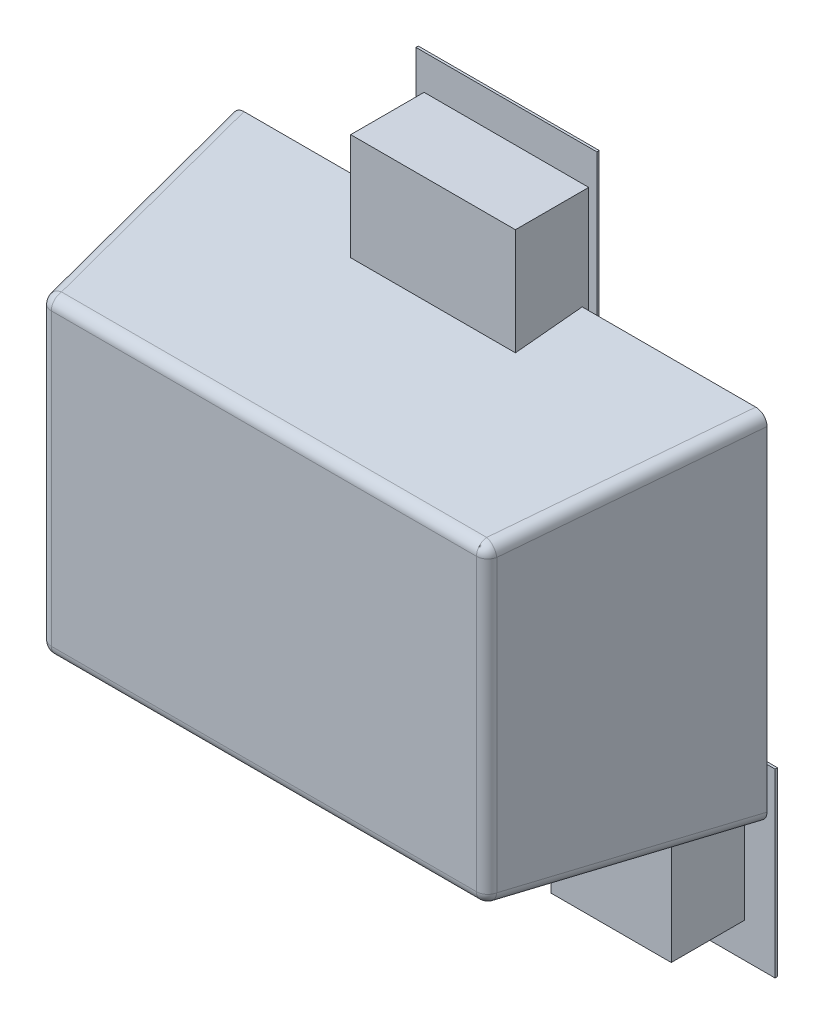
ISO-10303-21;
HEADER;
FILE_DESCRIPTION(('STEP AP214'),'2;1');
FILE_NAME('part.step','',(''),(''),'','','');
FILE_SCHEMA(('AUTOMOTIVE_DESIGN { 1 0 10303 214 1 1 1 1 }'));
ENDSEC;
DATA;
#1=APPLICATION_CONTEXT('core data for automotive mechanical design processes');
#2=APPLICATION_PROTOCOL_DEFINITION('international standard','automotive_design',2000,#1);
#3=PRODUCT_CONTEXT('',#1,'mechanical');
#4=PRODUCT('Part','Part','',(#3));
#5=PRODUCT_RELATED_PRODUCT_CATEGORY('part','',(#4));
#6=PRODUCT_DEFINITION_FORMATION('','',#4);
#7=PRODUCT_DEFINITION_CONTEXT('part definition',#1,'design');
#8=PRODUCT_DEFINITION('design','',#6,#7);
#9=PRODUCT_DEFINITION_SHAPE('','',#8);
#10=(LENGTH_UNIT() NAMED_UNIT(*) SI_UNIT(.MILLI.,.METRE.));
#11=(NAMED_UNIT(*) PLANE_ANGLE_UNIT() SI_UNIT($,.RADIAN.));
#12=(NAMED_UNIT(*) SI_UNIT($,.STERADIAN.) SOLID_ANGLE_UNIT());
#13=UNCERTAINTY_MEASURE_WITH_UNIT(LENGTH_MEASURE(1.E-05),#10,'distance_accuracy_value','');
#14=(GEOMETRIC_REPRESENTATION_CONTEXT(3) GLOBAL_UNCERTAINTY_ASSIGNED_CONTEXT((#13)) GLOBAL_UNIT_ASSIGNED_CONTEXT((#10,
#11,#12)) REPRESENTATION_CONTEXT('',''));
#15=CARTESIAN_POINT('',(0.,0.,0.));
#16=DIRECTION('',(0.,0.,1.));
#17=DIRECTION('',(1.,0.,0.));
#18=AXIS2_PLACEMENT_3D('',#15,#16,#17);
#19=CARTESIAN_POINT('',(0.,0.,0.0762));
#20=DIRECTION('',(0.,0.,1.));
#21=DIRECTION('',(1.,0.,0.));
#22=AXIS2_PLACEMENT_3D('',#19,#20,#21);
#23=PLANE('',#22);
#24=DIRECTION('',(1.,0.,0.));
#25=VECTOR('',#24,1.);
#26=CARTESIAN_POINT('',(-0.19685,-0.296926,0.0762));
#27=LINE('',#26,#25);
#28=CARTESIAN_POINT('',(-0.19685,-0.296926,0.0762));
#29=VERTEX_POINT('',#28);
#30=CARTESIAN_POINT('',(-0.60325,-0.296926,0.0762));
#31=VERTEX_POINT('',#30);
#32=EDGE_CURVE('E339',#29,#31,#27,.F.);
#33=ORIENTED_EDGE('',*,*,#32,.F.);
#34=DIRECTION('',(0.,1.,0.));
#35=VECTOR('',#34,1.);
#36=CARTESIAN_POINT('',(-0.19685,-0.703326,0.0762));
#37=LINE('',#36,#35);
#38=CARTESIAN_POINT('',(-0.19685,-0.703326,0.0762));
#39=VERTEX_POINT('',#38);
#40=EDGE_CURVE('E256',#39,#29,#37,.T.);
#41=ORIENTED_EDGE('',*,*,#40,.F.);
#42=DIRECTION('',(1.,0.,0.));
#43=VECTOR('',#42,1.);
#44=CARTESIAN_POINT('',(-0.60325,-0.703326,0.0762));
#45=LINE('',#44,#43);
#46=CARTESIAN_POINT('',(-0.60325,-0.703326,0.0762));
#47=VERTEX_POINT('',#46);
#48=EDGE_CURVE('E326',#47,#39,#45,.T.);
#49=ORIENTED_EDGE('',*,*,#48,.F.);
#50=DIRECTION('',(0.,1.,0.));
#51=VECTOR('',#50,1.);
#52=CARTESIAN_POINT('',(-0.60325,-0.296926,0.0762));
#53=LINE('',#52,#51);
#54=EDGE_CURVE('E334',#31,#47,#53,.F.);
#55=ORIENTED_EDGE('',*,*,#54,.F.);
#56=EDGE_LOOP('',(#33,#41,#49,#55));
#57=FACE_BOUND('',#56,.T.);
#58=ADVANCED_FACE('F16',(#57),#23,.F.);
#59=CARTESIAN_POINT('',(0.,0.,0.0762));
#60=DIRECTION('',(0.,0.,1.));
#61=DIRECTION('',(1.,0.,0.));
#62=AXIS2_PLACEMENT_3D('',#59,#60,#61);
#63=PLANE('',#62);
#64=DIRECTION('',(1.,0.,0.));
#65=VECTOR('',#64,1.);
#66=CARTESIAN_POINT('',(0.60325,-0.296926,0.0762));
#67=LINE('',#66,#65);
#68=CARTESIAN_POINT('',(0.60325,-0.296926,0.0762));
#69=VERTEX_POINT('',#68);
#70=CARTESIAN_POINT('',(0.19685,-0.296926,0.0762));
#71=VERTEX_POINT('',#70);
#72=EDGE_CURVE('E319',#69,#71,#67,.F.);
#73=ORIENTED_EDGE('',*,*,#72,.F.);
#74=DIRECTION('',(0.,1.,0.));
#75=VECTOR('',#74,1.);
#76=CARTESIAN_POINT('',(0.60325,-0.703326,0.0762));
#77=LINE('',#76,#75);
#78=CARTESIAN_POINT('',(0.60325,-0.703326,0.0762));
#79=VERTEX_POINT('',#78);
#80=EDGE_CURVE('E324',#79,#69,#77,.T.);
#81=ORIENTED_EDGE('',*,*,#80,.F.);
#82=DIRECTION('',(1.,0.,0.));
#83=VECTOR('',#82,1.);
#84=CARTESIAN_POINT('',(0.19685,-0.703326,0.0762));
#85=LINE('',#84,#83);
#86=CARTESIAN_POINT('',(0.19685,-0.703326,0.0762));
#87=VERTEX_POINT('',#86);
#88=EDGE_CURVE('E305',#87,#79,#85,.T.);
#89=ORIENTED_EDGE('',*,*,#88,.F.);
#90=DIRECTION('',(0.,1.,0.));
#91=VECTOR('',#90,1.);
#92=CARTESIAN_POINT('',(0.19685,-0.296926,0.0762));
#93=LINE('',#92,#91);
#94=EDGE_CURVE('E314',#71,#87,#93,.F.);
#95=ORIENTED_EDGE('',*,*,#94,.F.);
#96=EDGE_LOOP('',(#73,#81,#89,#95));
#97=FACE_BOUND('',#96,.T.);
#98=ADVANCED_FACE('F661',(#97),#63,.F.);
#99=CARTESIAN_POINT('',(0.,0.,0.0762));
#100=DIRECTION('',(0.,0.,1.));
#101=DIRECTION('',(1.,0.,0.));
#102=AXIS2_PLACEMENT_3D('',#99,#100,#101);
#103=PLANE('',#102);
#104=DIRECTION('',(1.,0.,0.));
#105=VECTOR('',#104,1.);
#106=CARTESIAN_POINT('',(-0.2032,0.296926,0.0762));
#107=LINE('',#106,#105);
#108=CARTESIAN_POINT('',(-0.2032,0.296926,0.0762));
#109=VERTEX_POINT('',#108);
#110=CARTESIAN_POINT('',(0.2032,0.296926,0.0762));
#111=VERTEX_POINT('',#110);
#112=EDGE_CURVE('E904',#109,#111,#107,.T.);
#113=ORIENTED_EDGE('',*,*,#112,.F.);
#114=DIRECTION('',(0.,1.,0.));
#115=VECTOR('',#114,1.);
#116=CARTESIAN_POINT('',(-0.2032,0.703326,0.0762));
#117=LINE('',#116,#115);
#118=CARTESIAN_POINT('',(-0.2032,0.703326,0.0762));
#119=VERTEX_POINT('',#118);
#120=EDGE_CURVE('E302',#119,#109,#117,.F.);
#121=ORIENTED_EDGE('',*,*,#120,.F.);
#122=DIRECTION('',(1.,0.,0.));
#123=VECTOR('',#122,1.);
#124=CARTESIAN_POINT('',(0.2032,0.703326,0.0762));
#125=LINE('',#124,#123);
#126=CARTESIAN_POINT('',(0.2032,0.703326,0.0762));
#127=VERTEX_POINT('',#126);
#128=EDGE_CURVE('E249',#127,#119,#125,.F.);
#129=ORIENTED_EDGE('',*,*,#128,.F.);
#130=DIRECTION('',(0.,1.,0.));
#131=VECTOR('',#130,1.);
#132=CARTESIAN_POINT('',(0.2032,0.296926,0.0762));
#133=LINE('',#132,#131);
#134=EDGE_CURVE('E74',#111,#127,#133,.T.);
#135=ORIENTED_EDGE('',*,*,#134,.F.);
#136=EDGE_LOOP('',(#113,#121,#129,#135));
#137=FACE_BOUND('',#136,.T.);
#138=ADVANCED_FACE('F659',(#137),#103,.F.);
#139=CARTESIAN_POINT('',(-0.19685,-0.703326,0.0762));
#140=DIRECTION('',(1.,0.,0.));
#141=DIRECTION('',(0.,0.,-1.));
#142=AXIS2_PLACEMENT_3D('',#139,#140,#141);
#143=PLANE('',#142);
#144=DIRECTION('',(0.,0.,-1.));
#145=VECTOR('',#144,1.);
#146=CARTESIAN_POINT('',(-0.19685,-0.703326,0.0762));
#147=LINE('',#146,#145);
#148=CARTESIAN_POINT('',(-0.19685,-0.703326,0.081534));
#149=VERTEX_POINT('',#148);
#150=EDGE_CURVE('E332',#39,#149,#147,.F.);
#151=ORIENTED_EDGE('',*,*,#150,.F.);
#152=ORIENTED_EDGE('',*,*,#40,.T.);
#153=DIRECTION('',(0.,0.,1.));
#154=VECTOR('',#153,1.);
#155=CARTESIAN_POINT('',(-0.19685,-0.296926,0.0762));
#156=LINE('',#155,#154);
#157=CARTESIAN_POINT('',(-0.19685,-0.296926,0.081534));
#158=VERTEX_POINT('',#157);
#159=EDGE_CURVE('E340',#158,#29,#156,.F.);
#160=ORIENTED_EDGE('',*,*,#159,.F.);
#161=DIRECTION('',(0.,1.,0.));
#162=VECTOR('',#161,1.);
#163=CARTESIAN_POINT('',(-0.19685,0.,0.081534));
#164=LINE('',#163,#162);
#165=EDGE_CURVE('E239',#149,#158,#164,.T.);
#166=ORIENTED_EDGE('',*,*,#165,.F.);
#167=EDGE_LOOP('',(#151,#152,#160,#166));
#168=FACE_BOUND('',#167,.T.);
#169=ADVANCED_FACE('F348',(#168),#143,.T.);
#170=CARTESIAN_POINT('',(-0.19685,-0.296926,0.0762));
#171=DIRECTION('',(0.,1.,0.));
#172=DIRECTION('',(0.,0.,1.));
#173=AXIS2_PLACEMENT_3D('',#170,#171,#172);
#174=PLANE('',#173);
#175=ORIENTED_EDGE('',*,*,#159,.T.);
#176=ORIENTED_EDGE('',*,*,#32,.T.);
#177=DIRECTION('',(0.,0.,1.));
#178=VECTOR('',#177,1.);
#179=CARTESIAN_POINT('',(-0.60325,-0.296926,0.0762));
#180=LINE('',#179,#178);
#181=CARTESIAN_POINT('',(-0.60325,-0.296926,0.081534));
#182=VERTEX_POINT('',#181);
#183=EDGE_CURVE('E336',#182,#31,#180,.F.);
#184=ORIENTED_EDGE('',*,*,#183,.F.);
#185=DIRECTION('',(1.,0.,0.));
#186=VECTOR('',#185,1.);
#187=CARTESIAN_POINT('',(0.,-0.296926,0.081534));
#188=LINE('',#187,#186);
#189=EDGE_CURVE('E244',#158,#182,#188,.F.);
#190=ORIENTED_EDGE('',*,*,#189,.F.);
#191=EDGE_LOOP('',(#175,#176,#184,#190));
#192=FACE_BOUND('',#191,.T.);
#193=ADVANCED_FACE('F654',(#192),#174,.T.);
#194=CARTESIAN_POINT('',(-0.60325,-0.296926,0.0762));
#195=DIRECTION('',(-1.,0.,0.));
#196=DIRECTION('',(0.,0.,1.));
#197=AXIS2_PLACEMENT_3D('',#194,#195,#196);
#198=PLANE('',#197);
#199=ORIENTED_EDGE('',*,*,#183,.T.);
#200=ORIENTED_EDGE('',*,*,#54,.T.);
#201=DIRECTION('',(0.,0.,-1.));
#202=VECTOR('',#201,1.);
#203=CARTESIAN_POINT('',(-0.60325,-0.703326,0.0762));
#204=LINE('',#203,#202);
#205=CARTESIAN_POINT('',(-0.60325,-0.703326,0.081534));
#206=VERTEX_POINT('',#205);
#207=EDGE_CURVE('E329',#206,#47,#204,.T.);
#208=ORIENTED_EDGE('',*,*,#207,.F.);
#209=DIRECTION('',(0.,1.,0.));
#210=VECTOR('',#209,1.);
#211=CARTESIAN_POINT('',(-0.60325,0.,0.081534));
#212=LINE('',#211,#210);
#213=EDGE_CURVE('E365',#182,#206,#212,.F.);
#214=ORIENTED_EDGE('',*,*,#213,.F.);
#215=EDGE_LOOP('',(#199,#200,#208,#214));
#216=FACE_BOUND('',#215,.T.);
#217=ADVANCED_FACE('F362',(#216),#198,.T.);
#218=CARTESIAN_POINT('',(-0.60325,-0.703326,0.0762));
#219=DIRECTION('',(0.,-1.,0.));
#220=DIRECTION('',(0.,0.,-1.));
#221=AXIS2_PLACEMENT_3D('',#218,#219,#220);
#222=PLANE('',#221);
#223=ORIENTED_EDGE('',*,*,#207,.T.);
#224=ORIENTED_EDGE('',*,*,#48,.T.);
#225=ORIENTED_EDGE('',*,*,#150,.T.);
#226=DIRECTION('',(1.,0.,0.));
#227=VECTOR('',#226,1.);
#228=CARTESIAN_POINT('',(0.,-0.703326,0.081534));
#229=LINE('',#228,#227);
#230=EDGE_CURVE('E359',#206,#149,#229,.T.);
#231=ORIENTED_EDGE('',*,*,#230,.F.);
#232=EDGE_LOOP('',(#223,#224,#225,#231));
#233=FACE_BOUND('',#232,.T.);
#234=ADVANCED_FACE('F354',(#233),#222,.T.);
#235=CARTESIAN_POINT('',(0.60325,-0.703326,0.0762));
#236=DIRECTION('',(1.,0.,0.));
#237=DIRECTION('',(0.,0.,-1.));
#238=AXIS2_PLACEMENT_3D('',#235,#236,#237);
#239=PLANE('',#238);
#240=DIRECTION('',(0.,0.,-1.));
#241=VECTOR('',#240,1.);
#242=CARTESIAN_POINT('',(0.60325,-0.703326,0.0762));
#243=LINE('',#242,#241);
#244=CARTESIAN_POINT('',(0.60325,-0.703326,0.081534));
#245=VERTEX_POINT('',#244);
#246=EDGE_CURVE('E311',#79,#245,#243,.F.);
#247=ORIENTED_EDGE('',*,*,#246,.F.);
#248=ORIENTED_EDGE('',*,*,#80,.T.);
#249=DIRECTION('',(0.,0.,1.));
#250=VECTOR('',#249,1.);
#251=CARTESIAN_POINT('',(0.60325,-0.296926,0.0762));
#252=LINE('',#251,#250);
#253=CARTESIAN_POINT('',(0.60325,-0.296926,0.081534));
#254=VERTEX_POINT('',#253);
#255=EDGE_CURVE('E321',#254,#69,#252,.F.);
#256=ORIENTED_EDGE('',*,*,#255,.F.);
#257=DIRECTION('',(0.,1.,0.));
#258=VECTOR('',#257,1.);
#259=CARTESIAN_POINT('',(0.60325,0.,0.081534));
#260=LINE('',#259,#258);
#261=EDGE_CURVE('E536',#245,#254,#260,.T.);
#262=ORIENTED_EDGE('',*,*,#261,.F.);
#263=EDGE_LOOP('',(#247,#248,#256,#262));
#264=FACE_BOUND('',#263,.T.);
#265=ADVANCED_FACE('F645',(#264),#239,.T.);
#266=CARTESIAN_POINT('',(0.60325,-0.296926,0.0762));
#267=DIRECTION('',(0.,1.,0.));
#268=DIRECTION('',(0.,0.,1.));
#269=AXIS2_PLACEMENT_3D('',#266,#267,#268);
#270=PLANE('',#269);
#271=ORIENTED_EDGE('',*,*,#255,.T.);
#272=ORIENTED_EDGE('',*,*,#72,.T.);
#273=DIRECTION('',(0.,0.,1.));
#274=VECTOR('',#273,1.);
#275=CARTESIAN_POINT('',(0.19685,-0.296926,0.0762));
#276=LINE('',#275,#274);
#277=CARTESIAN_POINT('',(0.19685,-0.296926,0.081534));
#278=VERTEX_POINT('',#277);
#279=EDGE_CURVE('E316',#278,#71,#276,.F.);
#280=ORIENTED_EDGE('',*,*,#279,.F.);
#281=DIRECTION('',(1.,0.,0.));
#282=VECTOR('',#281,1.);
#283=CARTESIAN_POINT('',(0.,-0.296926,0.081534));
#284=LINE('',#283,#282);
#285=EDGE_CURVE('E533',#254,#278,#284,.F.);
#286=ORIENTED_EDGE('',*,*,#285,.F.);
#287=EDGE_LOOP('',(#271,#272,#280,#286));
#288=FACE_BOUND('',#287,.T.);
#289=ADVANCED_FACE('F641',(#288),#270,.T.);
#290=CARTESIAN_POINT('',(0.19685,-0.296926,0.0762));
#291=DIRECTION('',(-1.,0.,0.));
#292=DIRECTION('',(0.,0.,1.));
#293=AXIS2_PLACEMENT_3D('',#290,#291,#292);
#294=PLANE('',#293);
#295=ORIENTED_EDGE('',*,*,#279,.T.);
#296=ORIENTED_EDGE('',*,*,#94,.T.);
#297=DIRECTION('',(0.,0.,-1.));
#298=VECTOR('',#297,1.);
#299=CARTESIAN_POINT('',(0.19685,-0.703326,0.0762));
#300=LINE('',#299,#298);
#301=CARTESIAN_POINT('',(0.19685,-0.703326,0.081534));
#302=VERTEX_POINT('',#301);
#303=EDGE_CURVE('E308',#302,#87,#300,.T.);
#304=ORIENTED_EDGE('',*,*,#303,.F.);
#305=DIRECTION('',(0.,1.,0.));
#306=VECTOR('',#305,1.);
#307=CARTESIAN_POINT('',(0.19685,0.,0.081534));
#308=LINE('',#307,#306);
#309=EDGE_CURVE('E530',#278,#302,#308,.F.);
#310=ORIENTED_EDGE('',*,*,#309,.F.);
#311=EDGE_LOOP('',(#295,#296,#304,#310));
#312=FACE_BOUND('',#311,.T.);
#313=ADVANCED_FACE('F637',(#312),#294,.T.);
#314=CARTESIAN_POINT('',(0.19685,-0.703326,0.0762));
#315=DIRECTION('',(0.,-1.,0.));
#316=DIRECTION('',(0.,0.,-1.));
#317=AXIS2_PLACEMENT_3D('',#314,#315,#316);
#318=PLANE('',#317);
#319=ORIENTED_EDGE('',*,*,#303,.T.);
#320=ORIENTED_EDGE('',*,*,#88,.T.);
#321=ORIENTED_EDGE('',*,*,#246,.T.);
#322=DIRECTION('',(1.,0.,0.));
#323=VECTOR('',#322,1.);
#324=CARTESIAN_POINT('',(0.,-0.703326,0.081534));
#325=LINE('',#324,#323);
#326=EDGE_CURVE('E527',#302,#245,#325,.T.);
#327=ORIENTED_EDGE('',*,*,#326,.F.);
#328=EDGE_LOOP('',(#319,#320,#321,#327));
#329=FACE_BOUND('',#328,.T.);
#330=ADVANCED_FACE('F634',(#329),#318,.T.);
#331=CARTESIAN_POINT('',(0.,0.,0.62611));
#332=DIRECTION('',(0.,0.,1.));
#333=DIRECTION('',(1.,0.,0.));
#334=AXIS2_PLACEMENT_3D('',#331,#332,#333);
#335=PLANE('',#334);
#336=DIRECTION('',(-1.,0.,0.));
#337=VECTOR('',#336,1.);
#338=CARTESIAN_POINT('',(2.2925861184,0.32611853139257,0.62611));
#339=LINE('',#338,#337);
#340=CARTESIAN_POINT('',(-0.477407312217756,0.32611853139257,0.62611));
#341=VERTEX_POINT('',#340);
#342=CARTESIAN_POINT('',(0.477407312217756,0.32611853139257,0.62611));
#343=VERTEX_POINT('',#342);
#344=EDGE_CURVE('E295',#341,#343,#339,.F.);
#345=ORIENTED_EDGE('',*,*,#344,.F.);
#346=DIRECTION('',(0.,-1.,0.));
#347=VECTOR('',#346,1.);
#348=CARTESIAN_POINT('',(-0.477407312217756,3.4870047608,0.62611));
#349=LINE('',#348,#347);
#350=CARTESIAN_POINT('',(-0.477407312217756,-0.32611853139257,0.62611));
#351=VERTEX_POINT('',#350);
#352=EDGE_CURVE('E62',#351,#341,#349,.F.);
#353=ORIENTED_EDGE('',*,*,#352,.F.);
#354=DIRECTION('',(1.,0.,0.));
#355=VECTOR('',#354,1.);
#356=CARTESIAN_POINT('',(-2.3215421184,-0.32611853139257,0.62611));
#357=LINE('',#356,#355);
#358=CARTESIAN_POINT('',(0.477407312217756,-0.32611853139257,0.62611));
#359=VERTEX_POINT('',#358);
#360=EDGE_CURVE('E199',#359,#351,#357,.F.);
#361=ORIENTED_EDGE('',*,*,#360,.F.);
#362=DIRECTION('',(0.,1.,0.));
#363=VECTOR('',#362,1.);
#364=CARTESIAN_POINT('',(0.477407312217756,-4.2157307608,0.62611));
#365=LINE('',#364,#363);
#366=EDGE_CURVE('E202',#343,#359,#365,.F.);
#367=ORIENTED_EDGE('',*,*,#366,.F.);
#368=EDGE_LOOP('',(#345,#353,#361,#367));
#369=FACE_BOUND('',#368,.T.);
#370=ADVANCED_FACE('F201',(#369),#335,.T.);
#371=CARTESIAN_POINT('',(-0.2032,0.703326,0.0762));
#372=DIRECTION('',(-1.,0.,0.));
#373=DIRECTION('',(0.,0.,1.));
#374=AXIS2_PLACEMENT_3D('',#371,#372,#373);
#375=PLANE('',#374);
#376=DIRECTION('',(0.,0.,1.));
#377=VECTOR('',#376,1.);
#378=CARTESIAN_POINT('',(-0.2032,0.703326,0.0762));
#379=LINE('',#378,#377);
#380=CARTESIAN_POINT('',(-0.2032,0.703326,0.081534));
#381=VERTEX_POINT('',#380);
#382=EDGE_CURVE('E898',#119,#381,#379,.T.);
#383=ORIENTED_EDGE('',*,*,#382,.F.);
#384=ORIENTED_EDGE('',*,*,#120,.T.);
#385=DIRECTION('',(0.,0.,-1.));
#386=VECTOR('',#385,1.);
#387=CARTESIAN_POINT('',(-0.2032,0.296926,0.0762));
#388=LINE('',#387,#386);
#389=CARTESIAN_POINT('',(-0.2032,0.296926,0.081534));
#390=VERTEX_POINT('',#389);
#391=EDGE_CURVE('E905',#390,#109,#388,.T.);
#392=ORIENTED_EDGE('',*,*,#391,.F.);
#393=DIRECTION('',(0.,1.,0.));
#394=VECTOR('',#393,1.);
#395=CARTESIAN_POINT('',(-0.2032,0.,0.081534));
#396=LINE('',#395,#394);
#397=EDGE_CURVE('E878',#381,#390,#396,.F.);
#398=ORIENTED_EDGE('',*,*,#397,.F.);
#399=EDGE_LOOP('',(#383,#384,#392,#398));
#400=FACE_BOUND('',#399,.T.);
#401=ADVANCED_FACE('F627',(#400),#375,.T.);
#402=CARTESIAN_POINT('',(-0.2032,0.296926,0.0762));
#403=DIRECTION('',(0.,-1.,0.));
#404=DIRECTION('',(0.,0.,-1.));
#405=AXIS2_PLACEMENT_3D('',#402,#403,#404);
#406=PLANE('',#405);
#407=ORIENTED_EDGE('',*,*,#391,.T.);
#408=ORIENTED_EDGE('',*,*,#112,.T.);
#409=DIRECTION('',(0.,0.,-1.));
#410=VECTOR('',#409,1.);
#411=CARTESIAN_POINT('',(0.2032,0.296926,0.0762));
#412=LINE('',#411,#410);
#413=CARTESIAN_POINT('',(0.2032,0.296926,0.081534));
#414=VERTEX_POINT('',#413);
#415=EDGE_CURVE('E902',#414,#111,#412,.T.);
#416=ORIENTED_EDGE('',*,*,#415,.F.);
#417=DIRECTION('',(1.,0.,0.));
#418=VECTOR('',#417,1.);
#419=CARTESIAN_POINT('',(0.,0.296926,0.081534));
#420=LINE('',#419,#418);
#421=EDGE_CURVE('E875',#390,#414,#420,.T.);
#422=ORIENTED_EDGE('',*,*,#421,.F.);
#423=EDGE_LOOP('',(#407,#408,#416,#422));
#424=FACE_BOUND('',#423,.T.);
#425=ADVANCED_FACE('F624',(#424),#406,.T.);
#426=CARTESIAN_POINT('',(0.2032,0.296926,0.0762));
#427=DIRECTION('',(1.,0.,0.));
#428=DIRECTION('',(0.,0.,-1.));
#429=AXIS2_PLACEMENT_3D('',#426,#427,#428);
#430=PLANE('',#429);
#431=ORIENTED_EDGE('',*,*,#415,.T.);
#432=ORIENTED_EDGE('',*,*,#134,.T.);
#433=DIRECTION('',(0.,0.,1.));
#434=VECTOR('',#433,1.);
#435=CARTESIAN_POINT('',(0.2032,0.703326,0.0762));
#436=LINE('',#435,#434);
#437=CARTESIAN_POINT('',(0.2032,0.703326,0.081534));
#438=VERTEX_POINT('',#437);
#439=EDGE_CURVE('E252',#438,#127,#436,.F.);
#440=ORIENTED_EDGE('',*,*,#439,.F.);
#441=DIRECTION('',(0.,1.,0.));
#442=VECTOR('',#441,1.);
#443=CARTESIAN_POINT('',(0.2032,0.,0.081534));
#444=LINE('',#443,#442);
#445=EDGE_CURVE('E872',#414,#438,#444,.T.);
#446=ORIENTED_EDGE('',*,*,#445,.F.);
#447=EDGE_LOOP('',(#431,#432,#440,#446));
#448=FACE_BOUND('',#447,.T.);
#449=ADVANCED_FACE('F620',(#448),#430,.T.);
#450=CARTESIAN_POINT('',(0.2032,0.703326,0.0762));
#451=DIRECTION('',(0.,1.,0.));
#452=DIRECTION('',(0.,0.,1.));
#453=AXIS2_PLACEMENT_3D('',#450,#451,#452);
#454=PLANE('',#453);
#455=ORIENTED_EDGE('',*,*,#439,.T.);
#456=ORIENTED_EDGE('',*,*,#128,.T.);
#457=ORIENTED_EDGE('',*,*,#382,.T.);
#458=DIRECTION('',(1.,0.,0.));
#459=VECTOR('',#458,1.);
#460=CARTESIAN_POINT('',(0.,0.703326,0.081534));
#461=LINE('',#460,#459);
#462=EDGE_CURVE('E421',#438,#381,#461,.F.);
#463=ORIENTED_EDGE('',*,*,#462,.F.);
#464=EDGE_LOOP('',(#455,#456,#457,#463));
#465=FACE_BOUND('',#464,.T.);
#466=ADVANCED_FACE('F616',(#465),#454,.T.);
#467=CARTESIAN_POINT('',(-0.477407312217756,0.32611853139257,0.60071));
#468=DIRECTION('',(-0.688301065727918,0.697639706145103,0.198847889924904));
#469=DIRECTION('',(0.187471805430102,-0.0937359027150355,0.977787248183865));
#470=AXIS2_PLACEMENT_3D('',#467,#468,#469);
#471=SPHERICAL_SURFACE('',#470,0.0254);
#472=CARTESIAN_POINT('',(-0.477407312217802,0.326118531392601,0.600710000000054));
#473=DIRECTION('',(-0.187471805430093,0.0937359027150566,-0.977787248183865));
#474=DIRECTION('',(-0.982111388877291,0.,0.188300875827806));
#475=AXIS2_PLACEMENT_3D('',#472,#473,#474);
#476=CIRCLE('',#475,0.0254);
#477=CARTESIAN_POINT('',(-0.494890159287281,0.343838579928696,0.605760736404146));
#478=VERTEX_POINT('',#477);
#479=CARTESIAN_POINT('',(-0.477407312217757,0.351402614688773,0.603133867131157));
#480=VERTEX_POINT('',#479);
#481=EDGE_CURVE('E287',#478,#480,#476,.T.);
#482=ORIENTED_EDGE('',*,*,#481,.F.);
#483=CARTESIAN_POINT('',(-0.477407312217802,0.326118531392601,0.600710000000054));
#484=DIRECTION('',(-0.187471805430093,0.0937359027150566,-0.977787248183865));
#485=DIRECTION('',(-0.982111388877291,0.,0.188300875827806));
#486=AXIS2_PLACEMENT_3D('',#483,#484,#485);
#487=CIRCLE('',#486,0.0254);
#488=CARTESIAN_POINT('',(-0.502352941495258,0.326118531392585,0.605492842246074));
#489=VERTEX_POINT('',#488);
#490=EDGE_CURVE('E290',#489,#478,#487,.T.);
#491=ORIENTED_EDGE('',*,*,#490,.F.);
#492=CARTESIAN_POINT('',(-0.477407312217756,0.32611853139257,0.60071));
#493=DIRECTION('',(0.,-1.,0.));
#494=DIRECTION('',(0.,0.,-1.));
#495=AXIS2_PLACEMENT_3D('',#492,#493,#494);
#496=CIRCLE('',#495,0.0254);
#497=EDGE_CURVE('E19',#341,#489,#496,.T.);
#498=ORIENTED_EDGE('',*,*,#497,.F.);
#499=CARTESIAN_POINT('',(-0.477407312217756,0.32611853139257,0.60071));
#500=DIRECTION('',(-1.,0.,0.));
#501=DIRECTION('',(0.,0.,1.));
#502=AXIS2_PLACEMENT_3D('',#499,#500,#501);
#503=CIRCLE('',#502,0.0254);
#504=EDGE_CURVE('E234',#480,#341,#503,.F.);
#505=ORIENTED_EDGE('',*,*,#504,.F.);
#506=EDGE_LOOP('',(#482,#491,#498,#505));
#507=FACE_BOUND('',#506,.T.);
#508=ADVANCED_FACE('F613',(#507),#471,.T.);
#509=CARTESIAN_POINT('',(-0.477407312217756,3.4870047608,0.60071));
#510=DIRECTION('',(0.,-1.,0.));
#511=DIRECTION('',(0.,0.,-1.));
#512=AXIS2_PLACEMENT_3D('',#509,#510,#511);
#513=CYLINDRICAL_SURFACE('',#512,0.0254);
#514=ORIENTED_EDGE('',*,*,#497,.T.);
#515=DIRECTION('',(0.,1.,0.));
#516=VECTOR('',#515,1.);
#517=CARTESIAN_POINT('',(-0.502352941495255,-0.399999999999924,0.605492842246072));
#518=LINE('',#517,#516);
#519=CARTESIAN_POINT('',(-0.502352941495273,-0.32611853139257,0.605492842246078));
#520=VERTEX_POINT('',#519);
#521=EDGE_CURVE('E289',#489,#520,#518,.F.);
#522=ORIENTED_EDGE('',*,*,#521,.T.);
#523=CARTESIAN_POINT('',(-0.477407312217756,-0.32611853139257,0.60071));
#524=DIRECTION('',(0.,-1.,0.));
#525=DIRECTION('',(0.,0.,-1.));
#526=AXIS2_PLACEMENT_3D('',#523,#524,#525);
#527=CIRCLE('',#526,0.0254);
#528=EDGE_CURVE('E238',#351,#520,#527,.T.);
#529=ORIENTED_EDGE('',*,*,#528,.F.);
#530=ORIENTED_EDGE('',*,*,#352,.T.);
#531=EDGE_LOOP('',(#514,#522,#529,#530));
#532=FACE_BOUND('',#531,.T.);
#533=ADVANCED_FACE('F609',(#532),#513,.T.);
#534=CARTESIAN_POINT('',(-0.477407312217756,-0.32611853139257,0.60071));
#535=DIRECTION('',(0.,-0.672522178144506,0.740076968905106));
#536=DIRECTION('',(-1.,0.,0.));
#537=AXIS2_PLACEMENT_3D('',#534,#535,#536);
#538=SPHERICAL_SURFACE('',#537,0.0254);
#539=CARTESIAN_POINT('',(-0.477407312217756,-0.32611853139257,0.60071));
#540=DIRECTION('',(1.,0.,0.));
#541=DIRECTION('',(0.,0.,-1.));
#542=AXIS2_PLACEMENT_3D('',#539,#540,#541);
#543=CIRCLE('',#542,0.0254);
#544=CARTESIAN_POINT('',(-0.477407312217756,-0.34320059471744,0.61950795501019));
#545=VERTEX_POINT('',#544);
#546=CARTESIAN_POINT('',(-0.477407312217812,-0.351402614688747,0.603133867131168));
#547=VERTEX_POINT('',#546);
#548=EDGE_CURVE('E206',#545,#547,#543,.T.);
#549=ORIENTED_EDGE('',*,*,#548,.F.);
#550=CARTESIAN_POINT('',(-0.477407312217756,-0.32611853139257,0.60071));
#551=DIRECTION('',(1.,0.,0.));
#552=DIRECTION('',(0.,0.,-1.));
#553=AXIS2_PLACEMENT_3D('',#550,#551,#552);
#554=CIRCLE('',#553,0.0254);
#555=EDGE_CURVE('E34',#351,#545,#554,.T.);
#556=ORIENTED_EDGE('',*,*,#555,.F.);
#557=ORIENTED_EDGE('',*,*,#528,.T.);
#558=CARTESIAN_POINT('',(-0.477407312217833,-0.326118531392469,0.600710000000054));
#559=DIRECTION('',(0.187471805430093,0.0937359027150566,0.977787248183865));
#560=DIRECTION('',(0.982111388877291,0.,-0.188300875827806));
#561=AXIS2_PLACEMENT_3D('',#558,#559,#560);
#562=CIRCLE('',#561,0.0254);
#563=EDGE_CURVE('E283',#547,#520,#562,.F.);
#564=ORIENTED_EDGE('',*,*,#563,.F.);
#565=EDGE_LOOP('',(#549,#556,#557,#564));
#566=FACE_BOUND('',#565,.T.);
#567=ADVANCED_FACE('F604',(#566),#538,.T.);
#568=CARTESIAN_POINT('',(-0.534924,-0.625094,0.0762));
#569=DIRECTION('',(0.,-1.,0.));
#570=DIRECTION('',(0.,0.,-1.));
#571=AXIS2_PLACEMENT_3D('',#568,#569,#570);
#572=PLANE('',#571);
#573=DIRECTION('',(0.,0.,1.));
#574=VECTOR('',#573,1.);
#575=CARTESIAN_POINT('',(-0.534924,-0.625094,0.0762));
#576=LINE('',#575,#574);
#577=CARTESIAN_POINT('',(-0.534924,-0.625094,0.081534));
#578=VERTEX_POINT('',#577);
#579=CARTESIAN_POINT('',(-0.534924,-0.625094,0.24619999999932));
#580=VERTEX_POINT('',#579);
#581=EDGE_CURVE('E524',#578,#580,#576,.T.);
#582=ORIENTED_EDGE('',*,*,#581,.F.);
#583=DIRECTION('',(1.,0.,0.));
#584=VECTOR('',#583,1.);
#585=CARTESIAN_POINT('',(0.,-0.625094,0.081534));
#586=LINE('',#585,#584);
#587=CARTESIAN_POINT('',(-0.264922,-0.625094,0.081534));
#588=VERTEX_POINT('',#587);
#589=EDGE_CURVE('E539',#588,#578,#586,.F.);
#590=ORIENTED_EDGE('',*,*,#589,.F.);
#591=DIRECTION('',(0.,0.,-1.));
#592=VECTOR('',#591,1.);
#593=CARTESIAN_POINT('',(-0.264922,-0.625094,0.0762));
#594=LINE('',#593,#592);
#595=CARTESIAN_POINT('',(-0.264922,-0.625094,0.24619999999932));
#596=VERTEX_POINT('',#595);
#597=EDGE_CURVE('E488',#596,#588,#594,.T.);
#598=ORIENTED_EDGE('',*,*,#597,.F.);
#599=DIRECTION('',(1.,0.,0.));
#600=VECTOR('',#599,1.);
#601=CARTESIAN_POINT('',(0.,-0.625094,0.24619999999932));
#602=LINE('',#601,#600);
#603=EDGE_CURVE('E228',#580,#596,#602,.T.);
#604=ORIENTED_EDGE('',*,*,#603,.F.);
#605=EDGE_LOOP('',(#582,#590,#598,#604));
#606=FACE_BOUND('',#605,.T.);
#607=ADVANCED_FACE('F608',(#606),#572,.T.);
#608=CARTESIAN_POINT('',(0.,0.,0.081534));
#609=DIRECTION('',(0.,0.,1.));
#610=DIRECTION('',(1.,0.,0.));
#611=AXIS2_PLACEMENT_3D('',#608,#609,#610);
#612=PLANE('',#611);
#613=ORIENTED_EDGE('',*,*,#589,.T.);
#614=DIRECTION('',(0.,1.,0.));
#615=VECTOR('',#614,1.);
#616=CARTESIAN_POINT('',(-0.534924,-0.376174,0.081534));
#617=LINE('',#616,#615);
#618=CARTESIAN_POINT('',(-0.534924,-0.376174,0.081534));
#619=VERTEX_POINT('',#618);
#620=EDGE_CURVE('E523',#619,#578,#617,.F.);
#621=ORIENTED_EDGE('',*,*,#620,.F.);
#622=DIRECTION('',(1.,0.,0.));
#623=VECTOR('',#622,1.);
#624=CARTESIAN_POINT('',(-0.264922,-0.376174,0.081534));
#625=LINE('',#624,#623);
#626=CARTESIAN_POINT('',(-0.264922,-0.376174,0.081534));
#627=VERTEX_POINT('',#626);
#628=EDGE_CURVE('E578',#627,#619,#625,.F.);
#629=ORIENTED_EDGE('',*,*,#628,.F.);
#630=DIRECTION('',(0.,1.,0.));
#631=VECTOR('',#630,1.);
#632=CARTESIAN_POINT('',(-0.264922,-0.625094,0.081534));
#633=LINE('',#632,#631);
#634=EDGE_CURVE('E566',#588,#627,#633,.T.);
#635=ORIENTED_EDGE('',*,*,#634,.F.);
#636=EDGE_LOOP('',(#613,#621,#629,#635));
#637=FACE_BOUND('',#636,.T.);
#638=ORIENTED_EDGE('',*,*,#213,.T.);
#639=ORIENTED_EDGE('',*,*,#230,.T.);
#640=ORIENTED_EDGE('',*,*,#165,.T.);
#641=ORIENTED_EDGE('',*,*,#189,.T.);
#642=EDGE_LOOP('',(#638,#639,#640,#641));
#643=FACE_BOUND('',#642,.T.);
#644=ADVANCED_FACE('F1014',(#637,#643),#612,.T.);
#645=CARTESIAN_POINT('',(0.264922,-0.625094,0.0762));
#646=DIRECTION('',(0.,-1.,0.));
#647=DIRECTION('',(0.,0.,-1.));
#648=AXIS2_PLACEMENT_3D('',#645,#646,#647);
#649=PLANE('',#648);
#650=DIRECTION('',(0.,0.,1.));
#651=VECTOR('',#650,1.);
#652=CARTESIAN_POINT('',(0.264922,-0.625094,0.0762));
#653=LINE('',#652,#651);
#654=CARTESIAN_POINT('',(0.264922,-0.625094,0.081534));
#655=VERTEX_POINT('',#654);
#656=CARTESIAN_POINT('',(0.264922,-0.625094,0.24619999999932));
#657=VERTEX_POINT('',#656);
#658=EDGE_CURVE('E502',#655,#657,#653,.T.);
#659=ORIENTED_EDGE('',*,*,#658,.F.);
#660=DIRECTION('',(1.,0.,0.));
#661=VECTOR('',#660,1.);
#662=CARTESIAN_POINT('',(0.,-0.625094,0.081534));
#663=LINE('',#662,#661);
#664=CARTESIAN_POINT('',(0.534924,-0.625094,0.081534));
#665=VERTEX_POINT('',#664);
#666=EDGE_CURVE('E520',#665,#655,#663,.F.);
#667=ORIENTED_EDGE('',*,*,#666,.F.);
#668=DIRECTION('',(0.,0.,-1.));
#669=VECTOR('',#668,1.);
#670=CARTESIAN_POINT('',(0.534924,-0.625094,0.0762));
#671=LINE('',#670,#669);
#672=CARTESIAN_POINT('',(0.534924,-0.625094,0.24619999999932));
#673=VERTEX_POINT('',#672);
#674=EDGE_CURVE('E515',#673,#665,#671,.T.);
#675=ORIENTED_EDGE('',*,*,#674,.F.);
#676=DIRECTION('',(1.,0.,0.));
#677=VECTOR('',#676,1.);
#678=CARTESIAN_POINT('',(0.,-0.625094,0.24619999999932));
#679=LINE('',#678,#677);
#680=EDGE_CURVE('E205',#657,#673,#679,.T.);
#681=ORIENTED_EDGE('',*,*,#680,.F.);
#682=EDGE_LOOP('',(#659,#667,#675,#681));
#683=FACE_BOUND('',#682,.T.);
#684=ADVANCED_FACE('F999',(#683),#649,.T.);
#685=CARTESIAN_POINT('',(0.,0.,0.081534));
#686=DIRECTION('',(0.,0.,1.));
#687=DIRECTION('',(1.,0.,0.));
#688=AXIS2_PLACEMENT_3D('',#685,#686,#687);
#689=PLANE('',#688);
#690=ORIENTED_EDGE('',*,*,#666,.T.);
#691=DIRECTION('',(0.,1.,0.));
#692=VECTOR('',#691,1.);
#693=CARTESIAN_POINT('',(0.264922,-0.376174,0.081534));
#694=LINE('',#693,#692);
#695=CARTESIAN_POINT('',(0.264922,-0.376174,0.081534));
#696=VERTEX_POINT('',#695);
#697=EDGE_CURVE('E501',#696,#655,#694,.F.);
#698=ORIENTED_EDGE('',*,*,#697,.F.);
#699=DIRECTION('',(1.,0.,0.));
#700=VECTOR('',#699,1.);
#701=CARTESIAN_POINT('',(0.534924,-0.376174,0.081534));
#702=LINE('',#701,#700);
#703=CARTESIAN_POINT('',(0.534924,-0.376174,0.081534));
#704=VERTEX_POINT('',#703);
#705=EDGE_CURVE('E547',#704,#696,#702,.F.);
#706=ORIENTED_EDGE('',*,*,#705,.F.);
#707=DIRECTION('',(0.,1.,0.));
#708=VECTOR('',#707,1.);
#709=CARTESIAN_POINT('',(0.534924,-0.625094,0.081534));
#710=LINE('',#709,#708);
#711=EDGE_CURVE('E544',#665,#704,#710,.T.);
#712=ORIENTED_EDGE('',*,*,#711,.F.);
#713=EDGE_LOOP('',(#690,#698,#706,#712));
#714=FACE_BOUND('',#713,.T.);
#715=ORIENTED_EDGE('',*,*,#309,.T.);
#716=ORIENTED_EDGE('',*,*,#326,.T.);
#717=ORIENTED_EDGE('',*,*,#261,.T.);
#718=ORIENTED_EDGE('',*,*,#285,.T.);
#719=EDGE_LOOP('',(#715,#716,#717,#718));
#720=FACE_BOUND('',#719,.T.);
#721=ADVANCED_FACE('F947',(#714,#720),#689,.T.);
#722=CARTESIAN_POINT('',(-2.3215421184,-0.32611853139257,0.60071));
#723=DIRECTION('',(1.,0.,0.));
#724=DIRECTION('',(0.,0.,-1.));
#725=AXIS2_PLACEMENT_3D('',#722,#723,#724);
#726=CYLINDRICAL_SURFACE('',#725,0.0254);
#727=CARTESIAN_POINT('',(0.477407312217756,-0.32611853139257,0.60071));
#728=DIRECTION('',(1.,0.,0.));
#729=DIRECTION('',(0.,0.,-1.));
#730=AXIS2_PLACEMENT_3D('',#727,#728,#729);
#731=CIRCLE('',#730,0.0254);
#732=CARTESIAN_POINT('',(0.477407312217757,-0.351402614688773,0.603133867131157));
#733=VERTEX_POINT('',#732);
#734=EDGE_CURVE('E217',#359,#733,#731,.T.);
#735=ORIENTED_EDGE('',*,*,#734,.F.);
#736=ORIENTED_EDGE('',*,*,#360,.T.);
#737=ORIENTED_EDGE('',*,*,#555,.T.);
#738=ORIENTED_EDGE('',*,*,#548,.T.);
#739=DIRECTION('',(1.,0.,0.));
#740=VECTOR('',#739,1.);
#741=CARTESIAN_POINT('',(-0.635,-0.351402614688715,0.603133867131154));
#742=LINE('',#741,#740);
#743=EDGE_CURVE('E223',#547,#733,#742,.T.);
#744=ORIENTED_EDGE('',*,*,#743,.T.);
#745=EDGE_LOOP('',(#735,#736,#737,#738,#744));
#746=FACE_BOUND('',#745,.T.);
#747=ADVANCED_FACE('F221',(#746),#726,.T.);
#748=CARTESIAN_POINT('',(0.,0.,0.24619999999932));
#749=DIRECTION('',(0.,0.,1.));
#750=DIRECTION('',(1.,0.,0.));
#751=AXIS2_PLACEMENT_3D('',#748,#749,#750);
#752=PLANE('',#751);
#753=DIRECTION('',(1.,0.,0.));
#754=VECTOR('',#753,1.);
#755=CARTESIAN_POINT('',(-0.635,-0.385620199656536,0.246199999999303));
#756=LINE('',#755,#754);
#757=CARTESIAN_POINT('',(0.534924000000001,-0.385620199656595,0.246199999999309));
#758=VERTEX_POINT('',#757);
#759=CARTESIAN_POINT('',(0.264922,-0.385620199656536,0.246199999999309));
#760=VERTEX_POINT('',#759);
#761=EDGE_CURVE('E505',#758,#760,#756,.F.);
#762=ORIENTED_EDGE('',*,*,#761,.T.);
#763=DIRECTION('',(0.,1.,0.));
#764=VECTOR('',#763,1.);
#765=CARTESIAN_POINT('',(0.264922,-0.376174,0.24619999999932));
#766=LINE('',#765,#764);
#767=EDGE_CURVE('E498',#657,#760,#766,.T.);
#768=ORIENTED_EDGE('',*,*,#767,.F.);
#769=ORIENTED_EDGE('',*,*,#680,.T.);
#770=DIRECTION('',(0.,1.,0.));
#771=VECTOR('',#770,1.);
#772=CARTESIAN_POINT('',(0.534924,-0.625094,0.24619999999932));
#773=LINE('',#772,#771);
#774=EDGE_CURVE('E512',#758,#673,#773,.F.);
#775=ORIENTED_EDGE('',*,*,#774,.F.);
#776=EDGE_LOOP('',(#762,#768,#769,#775));
#777=FACE_BOUND('',#776,.T.);
#778=ADVANCED_FACE('F1002',(#777),#752,.T.);
#779=CARTESIAN_POINT('',(0.,0.,0.24619999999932));
#780=DIRECTION('',(0.,0.,1.));
#781=DIRECTION('',(1.,0.,0.));
#782=AXIS2_PLACEMENT_3D('',#779,#780,#781);
#783=PLANE('',#782);
#784=DIRECTION('',(1.,0.,0.));
#785=VECTOR('',#784,1.);
#786=CARTESIAN_POINT('',(-0.635,-0.385620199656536,0.246199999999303));
#787=LINE('',#786,#785);
#788=CARTESIAN_POINT('',(-0.264922,-0.385620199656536,0.246199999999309));
#789=VERTEX_POINT('',#788);
#790=CARTESIAN_POINT('',(-0.534924,-0.385620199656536,0.246199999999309));
#791=VERTEX_POINT('',#790);
#792=EDGE_CURVE('E492',#789,#791,#787,.F.);
#793=ORIENTED_EDGE('',*,*,#792,.T.);
#794=DIRECTION('',(0.,1.,0.));
#795=VECTOR('',#794,1.);
#796=CARTESIAN_POINT('',(-0.534924,-0.376174,0.24619999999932));
#797=LINE('',#796,#795);
#798=EDGE_CURVE('E521',#580,#791,#797,.T.);
#799=ORIENTED_EDGE('',*,*,#798,.F.);
#800=ORIENTED_EDGE('',*,*,#603,.T.);
#801=DIRECTION('',(0.,1.,0.));
#802=VECTOR('',#801,1.);
#803=CARTESIAN_POINT('',(-0.264922,-0.625094,0.24619999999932));
#804=LINE('',#803,#802);
#805=EDGE_CURVE('E485',#789,#596,#804,.F.);
#806=ORIENTED_EDGE('',*,*,#805,.F.);
#807=EDGE_LOOP('',(#793,#799,#800,#806));
#808=FACE_BOUND('',#807,.T.);
#809=ADVANCED_FACE('F481',(#808),#783,.T.);
#810=CARTESIAN_POINT('',(0.477407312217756,-0.32611853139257,0.60071));
#811=DIRECTION('',(0.688301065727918,-0.697639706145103,0.198847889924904));
#812=DIRECTION('',(-0.187471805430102,0.0937359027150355,0.977787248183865));
#813=AXIS2_PLACEMENT_3D('',#810,#811,#812);
#814=SPHERICAL_SURFACE('',#813,0.0254);
#815=CARTESIAN_POINT('',(0.477407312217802,-0.326118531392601,0.600710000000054));
#816=DIRECTION('',(0.187471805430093,-0.0937359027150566,-0.977787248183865));
#817=DIRECTION('',(-0.982111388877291,0.,-0.188300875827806));
#818=AXIS2_PLACEMENT_3D('',#815,#816,#817);
#819=CIRCLE('',#818,0.0254);
#820=CARTESIAN_POINT('',(0.502352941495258,-0.326118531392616,0.605492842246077));
#821=VERTEX_POINT('',#820);
#822=CARTESIAN_POINT('',(0.494890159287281,-0.343838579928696,0.605760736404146));
#823=VERTEX_POINT('',#822);
#824=EDGE_CURVE('E231',#821,#823,#819,.T.);
#825=ORIENTED_EDGE('',*,*,#824,.F.);
#826=CARTESIAN_POINT('',(0.477407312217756,-0.32611853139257,0.60071));
#827=DIRECTION('',(0.,1.,0.));
#828=DIRECTION('',(0.,0.,1.));
#829=AXIS2_PLACEMENT_3D('',#826,#827,#828);
#830=CIRCLE('',#829,0.0254);
#831=EDGE_CURVE('E213',#359,#821,#830,.T.);
#832=ORIENTED_EDGE('',*,*,#831,.F.);
#833=ORIENTED_EDGE('',*,*,#734,.T.);
#834=CARTESIAN_POINT('',(0.477407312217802,-0.326118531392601,0.600710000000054));
#835=DIRECTION('',(0.187471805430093,-0.0937359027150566,-0.977787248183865));
#836=DIRECTION('',(-0.982111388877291,0.,-0.188300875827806));
#837=AXIS2_PLACEMENT_3D('',#834,#835,#836);
#838=CIRCLE('',#837,0.0254);
#839=EDGE_CURVE('E280',#823,#733,#838,.T.);
#840=ORIENTED_EDGE('',*,*,#839,.F.);
#841=EDGE_LOOP('',(#825,#832,#833,#840));
#842=FACE_BOUND('',#841,.T.);
#843=ADVANCED_FACE('F230',(#842),#814,.T.);
#844=CARTESIAN_POINT('',(0.477407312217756,-4.2157307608,0.60071));
#845=DIRECTION('',(0.,1.,0.));
#846=DIRECTION('',(0.,0.,1.));
#847=AXIS2_PLACEMENT_3D('',#844,#845,#846);
#848=CYLINDRICAL_SURFACE('',#847,0.0254);
#849=ORIENTED_EDGE('',*,*,#831,.T.);
#850=DIRECTION('',(0.,1.,0.));
#851=VECTOR('',#850,1.);
#852=CARTESIAN_POINT('',(0.502352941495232,-0.399999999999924,0.605492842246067));
#853=LINE('',#852,#851);
#854=CARTESIAN_POINT('',(0.502352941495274,0.326118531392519,0.605492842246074));
#855=VERTEX_POINT('',#854);
#856=EDGE_CURVE('E279',#821,#855,#853,.T.);
#857=ORIENTED_EDGE('',*,*,#856,.T.);
#858=CARTESIAN_POINT('',(0.477407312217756,0.32611853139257,0.60071));
#859=DIRECTION('',(0.,1.,0.));
#860=DIRECTION('',(0.,0.,1.));
#861=AXIS2_PLACEMENT_3D('',#858,#859,#860);
#862=CIRCLE('',#861,0.0254);
#863=EDGE_CURVE('E215',#343,#855,#862,.T.);
#864=ORIENTED_EDGE('',*,*,#863,.F.);
#865=ORIENTED_EDGE('',*,*,#366,.T.);
#866=EDGE_LOOP('',(#849,#857,#864,#865));
#867=FACE_BOUND('',#866,.T.);
#868=ADVANCED_FACE('F210',(#867),#848,.T.);
#869=CARTESIAN_POINT('',(0.477407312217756,0.32611853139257,0.60071));
#870=DIRECTION('',(0.,0.672522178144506,0.740076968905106));
#871=DIRECTION('',(1.,0.,0.));
#872=AXIS2_PLACEMENT_3D('',#869,#870,#871);
#873=SPHERICAL_SURFACE('',#872,0.0254);
#874=CARTESIAN_POINT('',(0.477407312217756,0.32611853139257,0.60071));
#875=DIRECTION('',(-1.,0.,0.));
#876=DIRECTION('',(0.,0.,1.));
#877=AXIS2_PLACEMENT_3D('',#874,#875,#876);
#878=CIRCLE('',#877,0.0254);
#879=CARTESIAN_POINT('',(0.477407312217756,0.34320059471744,0.61950795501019));
#880=VERTEX_POINT('',#879);
#881=CARTESIAN_POINT('',(0.477407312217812,0.351402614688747,0.603133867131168));
#882=VERTEX_POINT('',#881);
#883=EDGE_CURVE('E291',#880,#882,#878,.T.);
#884=ORIENTED_EDGE('',*,*,#883,.F.);
#885=CARTESIAN_POINT('',(0.477407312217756,0.32611853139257,0.60071));
#886=DIRECTION('',(-1.,0.,0.));
#887=DIRECTION('',(0.,0.,1.));
#888=AXIS2_PLACEMENT_3D('',#885,#886,#887);
#889=CIRCLE('',#888,0.0254);
#890=EDGE_CURVE('E293',#343,#880,#889,.T.);
#891=ORIENTED_EDGE('',*,*,#890,.F.);
#892=ORIENTED_EDGE('',*,*,#863,.T.);
#893=CARTESIAN_POINT('',(0.477407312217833,0.326118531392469,0.600710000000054));
#894=DIRECTION('',(-0.187471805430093,-0.0937359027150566,0.977787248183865));
#895=DIRECTION('',(0.982111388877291,0.,0.188300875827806));
#896=AXIS2_PLACEMENT_3D('',#893,#894,#895);
#897=CIRCLE('',#896,0.0254);
#898=EDGE_CURVE('E275',#882,#855,#897,.F.);
#899=ORIENTED_EDGE('',*,*,#898,.F.);
#900=EDGE_LOOP('',(#884,#891,#892,#899));
#901=FACE_BOUND('',#900,.T.);
#902=ADVANCED_FACE('F469',(#901),#873,.T.);
#903=CARTESIAN_POINT('',(2.2925861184,0.32611853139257,0.60071));
#904=DIRECTION('',(-1.,0.,0.));
#905=DIRECTION('',(0.,0.,1.));
#906=AXIS2_PLACEMENT_3D('',#903,#904,#905);
#907=CYLINDRICAL_SURFACE('',#906,0.0254);
#908=ORIENTED_EDGE('',*,*,#883,.T.);
#909=DIRECTION('',(1.,0.,0.));
#910=VECTOR('',#909,1.);
#911=CARTESIAN_POINT('',(-0.635,0.351402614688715,0.603133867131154));
#912=LINE('',#911,#910);
#913=EDGE_CURVE('E459',#882,#480,#912,.F.);
#914=ORIENTED_EDGE('',*,*,#913,.T.);
#915=ORIENTED_EDGE('',*,*,#504,.T.);
#916=ORIENTED_EDGE('',*,*,#344,.T.);
#917=ORIENTED_EDGE('',*,*,#890,.T.);
#918=EDGE_LOOP('',(#908,#914,#915,#916,#917));
#919=FACE_BOUND('',#918,.T.);
#920=ADVANCED_FACE('F473',(#919),#907,.T.);
#921=CARTESIAN_POINT('',(0.184912,0.625094,0.0762));
#922=DIRECTION('',(0.,1.,0.));
#923=DIRECTION('',(0.,0.,1.));
#924=AXIS2_PLACEMENT_3D('',#921,#922,#923);
#925=PLANE('',#924);
#926=DIRECTION('',(0.,0.,-1.));
#927=VECTOR('',#926,1.);
#928=CARTESIAN_POINT('',(0.184912,0.625094,0.0762));
#929=LINE('',#928,#927);
#930=CARTESIAN_POINT('',(0.184912,0.625094,0.081534));
#931=VERTEX_POINT('',#930);
#932=CARTESIAN_POINT('',(0.184912,0.625094,0.24619999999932));
#933=VERTEX_POINT('',#932);
#934=EDGE_CURVE('E427',#931,#933,#929,.F.);
#935=ORIENTED_EDGE('',*,*,#934,.F.);
#936=DIRECTION('',(1.,0.,0.));
#937=VECTOR('',#936,1.);
#938=CARTESIAN_POINT('',(0.,0.625094,0.081534));
#939=LINE('',#938,#937);
#940=CARTESIAN_POINT('',(-0.184912,0.625094,0.081534));
#941=VERTEX_POINT('',#940);
#942=EDGE_CURVE('E410',#941,#931,#939,.T.);
#943=ORIENTED_EDGE('',*,*,#942,.F.);
#944=DIRECTION('',(0.,0.,1.));
#945=VECTOR('',#944,1.);
#946=CARTESIAN_POINT('',(-0.184912,0.625094,0.0762));
#947=LINE('',#946,#945);
#948=CARTESIAN_POINT('',(-0.184912,0.625094,0.24619999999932));
#949=VERTEX_POINT('',#948);
#950=EDGE_CURVE('E454',#949,#941,#947,.F.);
#951=ORIENTED_EDGE('',*,*,#950,.F.);
#952=DIRECTION('',(1.,0.,0.));
#953=VECTOR('',#952,1.);
#954=CARTESIAN_POINT('',(0.,0.625094,0.24619999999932));
#955=LINE('',#954,#953);
#956=EDGE_CURVE('E292',#933,#949,#955,.F.);
#957=ORIENTED_EDGE('',*,*,#956,.F.);
#958=EDGE_LOOP('',(#935,#943,#951,#957));
#959=FACE_BOUND('',#958,.T.);
#960=ADVANCED_FACE('F433',(#959),#925,.T.);
#961=CARTESIAN_POINT('',(0.,0.,0.24619999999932));
#962=DIRECTION('',(0.,0.,1.));
#963=DIRECTION('',(1.,0.,0.));
#964=AXIS2_PLACEMENT_3D('',#961,#962,#963);
#965=PLANE('',#964);
#966=DIRECTION('',(1.,0.,0.));
#967=VECTOR('',#966,1.);
#968=CARTESIAN_POINT('',(-0.635,0.385620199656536,0.246199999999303));
#969=LINE('',#968,#967);
#970=CARTESIAN_POINT('',(-0.184912,0.385620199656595,0.246199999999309));
#971=VERTEX_POINT('',#970);
#972=CARTESIAN_POINT('',(0.184912,0.385620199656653,0.246199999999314));
#973=VERTEX_POINT('',#972);
#974=EDGE_CURVE('E436',#971,#973,#969,.T.);
#975=ORIENTED_EDGE('',*,*,#974,.T.);
#976=DIRECTION('',(0.,1.,0.));
#977=VECTOR('',#976,1.);
#978=CARTESIAN_POINT('',(0.184912,0.376174,0.24619999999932));
#979=LINE('',#978,#977);
#980=EDGE_CURVE('E435',#933,#973,#979,.F.);
#981=ORIENTED_EDGE('',*,*,#980,.F.);
#982=ORIENTED_EDGE('',*,*,#956,.T.);
#983=DIRECTION('',(0.,1.,0.));
#984=VECTOR('',#983,1.);
#985=CARTESIAN_POINT('',(-0.184912,0.625094,0.24619999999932));
#986=LINE('',#985,#984);
#987=EDGE_CURVE('E451',#971,#949,#986,.T.);
#988=ORIENTED_EDGE('',*,*,#987,.F.);
#989=EDGE_LOOP('',(#975,#981,#982,#988));
#990=FACE_BOUND('',#989,.T.);
#991=ADVANCED_FACE('F746',(#990),#965,.T.);
#992=CARTESIAN_POINT('',(0.,0.,0.081534));
#993=DIRECTION('',(0.,0.,1.));
#994=DIRECTION('',(1.,0.,0.));
#995=AXIS2_PLACEMENT_3D('',#992,#993,#994);
#996=PLANE('',#995);
#997=DIRECTION('',(0.,1.,0.));
#998=VECTOR('',#997,1.);
#999=CARTESIAN_POINT('',(0.184912,0.376174,0.081534));
#1000=LINE('',#999,#998);
#1001=CARTESIAN_POINT('',(0.184912,0.376174,0.081534));
#1002=VERTEX_POINT('',#1001);
#1003=EDGE_CURVE('E414',#1002,#931,#1000,.T.);
#1004=ORIENTED_EDGE('',*,*,#1003,.F.);
#1005=DIRECTION('',(1.,0.,0.));
#1006=VECTOR('',#1005,1.);
#1007=CARTESIAN_POINT('',(-0.184912,0.376174,0.081534));
#1008=LINE('',#1007,#1006);
#1009=CARTESIAN_POINT('',(-0.184912,0.376174,0.081534));
#1010=VERTEX_POINT('',#1009);
#1011=EDGE_CURVE('E420',#1010,#1002,#1008,.T.);
#1012=ORIENTED_EDGE('',*,*,#1011,.F.);
#1013=DIRECTION('',(0.,1.,0.));
#1014=VECTOR('',#1013,1.);
#1015=CARTESIAN_POINT('',(-0.184912,0.625094,0.081534));
#1016=LINE('',#1015,#1014);
#1017=EDGE_CURVE('E416',#941,#1010,#1016,.F.);
#1018=ORIENTED_EDGE('',*,*,#1017,.F.);
#1019=ORIENTED_EDGE('',*,*,#942,.T.);
#1020=EDGE_LOOP('',(#1004,#1012,#1018,#1019));
#1021=FACE_BOUND('',#1020,.T.);
#1022=ORIENTED_EDGE('',*,*,#445,.T.);
#1023=ORIENTED_EDGE('',*,*,#462,.T.);
#1024=ORIENTED_EDGE('',*,*,#397,.T.);
#1025=ORIENTED_EDGE('',*,*,#421,.T.);
#1026=EDGE_LOOP('',(#1022,#1023,#1024,#1025));
#1027=FACE_BOUND('',#1026,.T.);
#1028=ADVANCED_FACE('F412',(#1021,#1027),#996,.T.);
#1029=CARTESIAN_POINT('',(-0.184912,0.376174,0.0762));
#1030=DIRECTION('',(0.,-1.,0.));
#1031=DIRECTION('',(0.,0.,-1.));
#1032=AXIS2_PLACEMENT_3D('',#1029,#1030,#1031);
#1033=PLANE('',#1032);
#1034=DIRECTION('',(0.,0.,1.));
#1035=VECTOR('',#1034,1.);
#1036=CARTESIAN_POINT('',(-0.184912,0.376174,0.0762));
#1037=LINE('',#1036,#1035);
#1038=CARTESIAN_POINT('',(-0.184912,0.376174,0.0961999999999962));
#1039=VERTEX_POINT('',#1038);
#1040=EDGE_CURVE('E455',#1010,#1039,#1037,.T.);
#1041=ORIENTED_EDGE('',*,*,#1040,.F.);
#1042=ORIENTED_EDGE('',*,*,#1011,.T.);
#1043=DIRECTION('',(0.,0.,-1.));
#1044=VECTOR('',#1043,1.);
#1045=CARTESIAN_POINT('',(0.184912,0.376174,0.0762));
#1046=LINE('',#1045,#1044);
#1047=CARTESIAN_POINT('',(0.184912,0.376174,0.0961999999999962));
#1048=VERTEX_POINT('',#1047);
#1049=EDGE_CURVE('E430',#1048,#1002,#1046,.T.);
#1050=ORIENTED_EDGE('',*,*,#1049,.F.);
#1051=DIRECTION('',(1.,0.,0.));
#1052=VECTOR('',#1051,1.);
#1053=CARTESIAN_POINT('',(0.,0.376174,0.0961999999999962));
#1054=LINE('',#1053,#1052);
#1055=EDGE_CURVE('E431',#1048,#1039,#1054,.F.);
#1056=ORIENTED_EDGE('',*,*,#1055,.T.);
#1057=EDGE_LOOP('',(#1041,#1042,#1050,#1056));
#1058=FACE_BOUND('',#1057,.T.);
#1059=ADVANCED_FACE('F739',(#1058),#1033,.T.);
#1060=CARTESIAN_POINT('',(-0.184912,0.625094,0.0762));
#1061=DIRECTION('',(-1.,0.,0.));
#1062=DIRECTION('',(0.,0.,1.));
#1063=AXIS2_PLACEMENT_3D('',#1060,#1061,#1062);
#1064=PLANE('',#1063);
#1065=ORIENTED_EDGE('',*,*,#950,.T.);
#1066=ORIENTED_EDGE('',*,*,#1017,.T.);
#1067=ORIENTED_EDGE('',*,*,#1040,.T.);
#1068=DIRECTION('',(0.,1.,0.));
#1069=VECTOR('',#1068,1.);
#1070=CARTESIAN_POINT('',(-0.184912,0.,0.0961999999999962));
#1071=LINE('',#1070,#1069);
#1072=CARTESIAN_POINT('',(-0.184912,0.399999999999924,0.0961999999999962));
#1073=VERTEX_POINT('',#1072);
#1074=EDGE_CURVE('E855',#1039,#1073,#1071,.T.);
#1075=ORIENTED_EDGE('',*,*,#1074,.T.);
#1076=DIRECTION('',(0.,0.0954278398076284,-0.995436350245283));
#1077=VECTOR('',#1076,1.);
#1078=CARTESIAN_POINT('',(-0.184912,0.349199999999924,0.62611));
#1079=LINE('',#1078,#1077);
#1080=EDGE_CURVE('E441',#1073,#971,#1079,.F.);
#1081=ORIENTED_EDGE('',*,*,#1080,.T.);
#1082=ORIENTED_EDGE('',*,*,#987,.T.);
#1083=EDGE_LOOP('',(#1065,#1066,#1067,#1075,#1081,#1082));
#1084=FACE_BOUND('',#1083,.T.);
#1085=ADVANCED_FACE('F735',(#1084),#1064,.T.);
#1086=CARTESIAN_POINT('',(-0.335092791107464,0.254961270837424,1.342972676));
#1087=DIRECTION('',(-0.187471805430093,0.0937359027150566,-0.977787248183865));
#1088=DIRECTION('',(-0.982111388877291,0.,0.188300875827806));
#1089=AXIS2_PLACEMENT_3D('',#1086,#1087,#1088);
#1090=CYLINDRICAL_SURFACE('',#1089,0.0254);
#1091=DIRECTION('',(-0.187471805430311,0.0937359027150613,-0.977787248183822));
#1092=VECTOR('',#1091,1.);
#1093=CARTESIAN_POINT('',(-0.477407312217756,0.351402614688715,0.603133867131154));
#1094=LINE('',#1093,#1092);
#1095=CARTESIAN_POINT('',(-0.574602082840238,0.39999999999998,0.0961999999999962));
#1096=VERTEX_POINT('',#1095);
#1097=EDGE_CURVE('E460',#480,#1096,#1094,.T.);
#1098=ORIENTED_EDGE('',*,*,#1097,.T.);
#1099=CARTESIAN_POINT('',(-0.574137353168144,0.374483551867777,0.0961999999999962));
#1100=DIRECTION('',(0.,0.,1.));
#1101=DIRECTION('',(-0.894427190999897,0.447213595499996,0.));
#1102=AXIS2_PLACEMENT_3D('',#1099,#1100,#1101);
#1103=ELLIPSE('',#1102,0.0259770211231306,0.0254);
#1104=CARTESIAN_POINT('',(-0.599999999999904,0.374942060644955,0.0961999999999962));
#1105=VERTEX_POINT('',#1104);
#1106=EDGE_CURVE('E271',#1096,#1105,#1103,.T.);
#1107=ORIENTED_EDGE('',*,*,#1106,.T.);
#1108=DIRECTION('',(0.187471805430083,-0.0937359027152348,0.97778724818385));
#1109=VECTOR('',#1108,1.);
#1110=CARTESIAN_POINT('',(-0.599999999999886,0.374942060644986,0.0961999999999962));
#1111=LINE('',#1110,#1109);
#1112=EDGE_CURVE('E286',#1105,#489,#1111,.T.);
#1113=ORIENTED_EDGE('',*,*,#1112,.T.);
#1114=ORIENTED_EDGE('',*,*,#490,.T.);
#1115=ORIENTED_EDGE('',*,*,#481,.T.);
#1116=EDGE_LOOP('',(#1098,#1107,#1113,#1114,#1115));
#1117=FACE_BOUND('',#1116,.T.);
#1118=ADVANCED_FACE('F731',(#1117),#1090,.T.);
#1119=CARTESIAN_POINT('',(-0.599999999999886,-0.399999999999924,0.0961999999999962));
#1120=DIRECTION('',(0.982111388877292,0.,-0.188300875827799));
#1121=DIRECTION('',(-0.188300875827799,0.,-0.982111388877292));
#1122=AXIS2_PLACEMENT_3D('',#1119,#1120,#1121);
#1123=PLANE('',#1122);
#1124=DIRECTION('',(0.,1.,0.));
#1125=VECTOR('',#1124,1.);
#1126=CARTESIAN_POINT('',(-0.599999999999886,0.,0.0961999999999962));
#1127=LINE('',#1126,#1125);
#1128=CARTESIAN_POINT('',(-0.599999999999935,-0.374942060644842,0.0961999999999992));
#1129=VERTEX_POINT('',#1128);
#1130=EDGE_CURVE('E270',#1105,#1129,#1127,.F.);
#1131=ORIENTED_EDGE('',*,*,#1130,.T.);
#1132=DIRECTION('',(0.187471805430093,0.0937359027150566,0.977787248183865));
#1133=VECTOR('',#1132,1.);
#1134=CARTESIAN_POINT('',(-0.740362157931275,-0.445123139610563,-0.635879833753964));
#1135=LINE('',#1134,#1133);
#1136=EDGE_CURVE('E285',#520,#1129,#1135,.F.);
#1137=ORIENTED_EDGE('',*,*,#1136,.F.);
#1138=ORIENTED_EDGE('',*,*,#521,.F.);
#1139=ORIENTED_EDGE('',*,*,#1112,.F.);
#1140=EDGE_LOOP('',(#1131,#1137,#1138,#1139));
#1141=FACE_BOUND('',#1140,.T.);
#1142=ADVANCED_FACE('F727',(#1141),#1123,.F.);
#1143=CARTESIAN_POINT('',(-0.715416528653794,-0.445123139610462,-0.640662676));
#1144=DIRECTION('',(0.187471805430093,0.0937359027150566,0.977787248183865));
#1145=DIRECTION('',(0.982111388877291,0.,-0.188300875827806));
#1146=AXIS2_PLACEMENT_3D('',#1143,#1144,#1145);
#1147=CYLINDRICAL_SURFACE('',#1146,0.0254);
#1148=ORIENTED_EDGE('',*,*,#1136,.T.);
#1149=CARTESIAN_POINT('',(-0.574137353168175,-0.374483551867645,0.0961999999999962));
#1150=DIRECTION('',(0.,0.,1.));
#1151=DIRECTION('',(0.894427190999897,0.447213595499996,0.));
#1152=AXIS2_PLACEMENT_3D('',#1149,#1150,#1151);
#1153=ELLIPSE('',#1152,0.0259770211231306,0.0254);
#1154=CARTESIAN_POINT('',(-0.574602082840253,-0.399999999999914,0.0961999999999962));
#1155=VERTEX_POINT('',#1154);
#1156=EDGE_CURVE('E266',#1129,#1155,#1153,.T.);
#1157=ORIENTED_EDGE('',*,*,#1156,.T.);
#1158=DIRECTION('',(0.187471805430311,0.0937359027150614,0.977787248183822));
#1159=VECTOR('',#1158,1.);
#1160=CARTESIAN_POINT('',(-0.574602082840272,-0.399999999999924,0.0961999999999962));
#1161=LINE('',#1160,#1159);
#1162=EDGE_CURVE('E840',#1155,#547,#1161,.T.);
#1163=ORIENTED_EDGE('',*,*,#1162,.T.);
#1164=ORIENTED_EDGE('',*,*,#563,.T.);
#1165=EDGE_LOOP('',(#1148,#1157,#1163,#1164));
#1166=FACE_BOUND('',#1165,.T.);
#1167=ADVANCED_FACE('F723',(#1166),#1147,.T.);
#1168=CARTESIAN_POINT('',(-0.534924,-0.376174,0.0762));
#1169=DIRECTION('',(-1.,0.,0.));
#1170=DIRECTION('',(0.,0.,1.));
#1171=AXIS2_PLACEMENT_3D('',#1168,#1169,#1170);
#1172=PLANE('',#1171);
#1173=DIRECTION('',(0.,0.,1.));
#1174=VECTOR('',#1173,1.);
#1175=CARTESIAN_POINT('',(-0.534924,-0.376174,0.0762));
#1176=LINE('',#1175,#1174);
#1177=CARTESIAN_POINT('',(-0.534924,-0.376174,0.0961999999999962));
#1178=VERTEX_POINT('',#1177);
#1179=EDGE_CURVE('E581',#619,#1178,#1176,.T.);
#1180=ORIENTED_EDGE('',*,*,#1179,.F.);
#1181=ORIENTED_EDGE('',*,*,#620,.T.);
#1182=ORIENTED_EDGE('',*,*,#581,.T.);
#1183=ORIENTED_EDGE('',*,*,#798,.T.);
#1184=DIRECTION('',(0.,0.0954278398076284,0.995436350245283));
#1185=VECTOR('',#1184,1.);
#1186=CARTESIAN_POINT('',(-0.534924,-0.399999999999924,0.0961999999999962));
#1187=LINE('',#1186,#1185);
#1188=CARTESIAN_POINT('',(-0.534924,-0.399999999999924,0.0961999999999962));
#1189=VERTEX_POINT('',#1188);
#1190=EDGE_CURVE('E555',#791,#1189,#1187,.F.);
#1191=ORIENTED_EDGE('',*,*,#1190,.T.);
#1192=DIRECTION('',(0.,1.,0.));
#1193=VECTOR('',#1192,1.);
#1194=CARTESIAN_POINT('',(-0.534924,0.,0.0961999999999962));
#1195=LINE('',#1194,#1193);
#1196=EDGE_CURVE('E830',#1189,#1178,#1195,.T.);
#1197=ORIENTED_EDGE('',*,*,#1196,.T.);
#1198=EDGE_LOOP('',(#1180,#1181,#1182,#1183,#1191,#1197));
#1199=FACE_BOUND('',#1198,.T.);
#1200=ADVANCED_FACE('F719',(#1199),#1172,.T.);
#1201=CARTESIAN_POINT('',(-0.264922,-0.376174,0.0762));
#1202=DIRECTION('',(0.,1.,0.));
#1203=DIRECTION('',(0.,0.,1.));
#1204=AXIS2_PLACEMENT_3D('',#1201,#1202,#1203);
#1205=PLANE('',#1204);
#1206=DIRECTION('',(0.,0.,-1.));
#1207=VECTOR('',#1206,1.);
#1208=CARTESIAN_POINT('',(-0.264922,-0.376174,0.0762));
#1209=LINE('',#1208,#1207);
#1210=CARTESIAN_POINT('',(-0.264922,-0.376174,0.0961999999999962));
#1211=VERTEX_POINT('',#1210);
#1212=EDGE_CURVE('E489',#627,#1211,#1209,.F.);
#1213=ORIENTED_EDGE('',*,*,#1212,.F.);
#1214=ORIENTED_EDGE('',*,*,#628,.T.);
#1215=ORIENTED_EDGE('',*,*,#1179,.T.);
#1216=DIRECTION('',(1.,0.,0.));
#1217=VECTOR('',#1216,1.);
#1218=CARTESIAN_POINT('',(0.,-0.376174,0.0961999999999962));
#1219=LINE('',#1218,#1217);
#1220=EDGE_CURVE('E822',#1178,#1211,#1219,.T.);
#1221=ORIENTED_EDGE('',*,*,#1220,.T.);
#1222=EDGE_LOOP('',(#1213,#1214,#1215,#1221));
#1223=FACE_BOUND('',#1222,.T.);
#1224=ADVANCED_FACE('F715',(#1223),#1205,.T.);
#1225=CARTESIAN_POINT('',(-0.264922,-0.625094,0.0762));
#1226=DIRECTION('',(1.,0.,0.));
#1227=DIRECTION('',(0.,0.,-1.));
#1228=AXIS2_PLACEMENT_3D('',#1225,#1226,#1227);
#1229=PLANE('',#1228);
#1230=ORIENTED_EDGE('',*,*,#597,.T.);
#1231=ORIENTED_EDGE('',*,*,#634,.T.);
#1232=ORIENTED_EDGE('',*,*,#1212,.T.);
#1233=DIRECTION('',(0.,1.,0.));
#1234=VECTOR('',#1233,1.);
#1235=CARTESIAN_POINT('',(-0.264922,0.,0.0961999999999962));
#1236=LINE('',#1235,#1234);
#1237=CARTESIAN_POINT('',(-0.264922,-0.399999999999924,0.0961999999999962));
#1238=VERTEX_POINT('',#1237);
#1239=EDGE_CURVE('E809',#1211,#1238,#1236,.F.);
#1240=ORIENTED_EDGE('',*,*,#1239,.T.);
#1241=DIRECTION('',(0.,0.0954278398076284,0.995436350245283));
#1242=VECTOR('',#1241,1.);
#1243=CARTESIAN_POINT('',(-0.264922,-0.399999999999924,0.0961999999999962));
#1244=LINE('',#1243,#1242);
#1245=EDGE_CURVE('E495',#1238,#789,#1244,.T.);
#1246=ORIENTED_EDGE('',*,*,#1245,.T.);
#1247=ORIENTED_EDGE('',*,*,#805,.T.);
#1248=EDGE_LOOP('',(#1230,#1231,#1232,#1240,#1246,#1247));
#1249=FACE_BOUND('',#1248,.T.);
#1250=ADVANCED_FACE('F711',(#1249),#1229,.T.);
#1251=CARTESIAN_POINT('',(0.264922,-0.376174,0.0762));
#1252=DIRECTION('',(-1.,0.,0.));
#1253=DIRECTION('',(0.,0.,1.));
#1254=AXIS2_PLACEMENT_3D('',#1251,#1252,#1253);
#1255=PLANE('',#1254);
#1256=DIRECTION('',(0.,0.,1.));
#1257=VECTOR('',#1256,1.);
#1258=CARTESIAN_POINT('',(0.264922,-0.376174,0.0762));
#1259=LINE('',#1258,#1257);
#1260=CARTESIAN_POINT('',(0.264922,-0.376174,0.0961999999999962));
#1261=VERTEX_POINT('',#1260);
#1262=EDGE_CURVE('E550',#696,#1261,#1259,.T.);
#1263=ORIENTED_EDGE('',*,*,#1262,.F.);
#1264=ORIENTED_EDGE('',*,*,#697,.T.);
#1265=ORIENTED_EDGE('',*,*,#658,.T.);
#1266=ORIENTED_EDGE('',*,*,#767,.T.);
#1267=DIRECTION('',(0.,0.0954278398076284,0.995436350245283));
#1268=VECTOR('',#1267,1.);
#1269=CARTESIAN_POINT('',(0.264922,-0.399999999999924,0.0961999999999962));
#1270=LINE('',#1269,#1268);
#1271=CARTESIAN_POINT('',(0.264922,-0.399999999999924,0.0961999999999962));
#1272=VERTEX_POINT('',#1271);
#1273=EDGE_CURVE('E508',#760,#1272,#1270,.F.);
#1274=ORIENTED_EDGE('',*,*,#1273,.T.);
#1275=DIRECTION('',(0.,1.,0.));
#1276=VECTOR('',#1275,1.);
#1277=CARTESIAN_POINT('',(0.264922,0.,0.0961999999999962));
#1278=LINE('',#1277,#1276);
#1279=EDGE_CURVE('E795',#1272,#1261,#1278,.T.);
#1280=ORIENTED_EDGE('',*,*,#1279,.T.);
#1281=EDGE_LOOP('',(#1263,#1264,#1265,#1266,#1274,#1280));
#1282=FACE_BOUND('',#1281,.T.);
#1283=ADVANCED_FACE('F707',(#1282),#1255,.T.);
#1284=CARTESIAN_POINT('',(0.534924,-0.376174,0.0762));
#1285=DIRECTION('',(0.,1.,0.));
#1286=DIRECTION('',(0.,0.,1.));
#1287=AXIS2_PLACEMENT_3D('',#1284,#1285,#1286);
#1288=PLANE('',#1287);
#1289=DIRECTION('',(0.,0.,-1.));
#1290=VECTOR('',#1289,1.);
#1291=CARTESIAN_POINT('',(0.534924,-0.376174,0.0762));
#1292=LINE('',#1291,#1290);
#1293=CARTESIAN_POINT('',(0.534924,-0.376174,0.0961999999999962));
#1294=VERTEX_POINT('',#1293);
#1295=EDGE_CURVE('E516',#704,#1294,#1292,.F.);
#1296=ORIENTED_EDGE('',*,*,#1295,.F.);
#1297=ORIENTED_EDGE('',*,*,#705,.T.);
#1298=ORIENTED_EDGE('',*,*,#1262,.T.);
#1299=DIRECTION('',(1.,0.,0.));
#1300=VECTOR('',#1299,1.);
#1301=CARTESIAN_POINT('',(0.,-0.376174,0.0961999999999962));
#1302=LINE('',#1301,#1300);
#1303=EDGE_CURVE('E786',#1261,#1294,#1302,.T.);
#1304=ORIENTED_EDGE('',*,*,#1303,.T.);
#1305=EDGE_LOOP('',(#1296,#1297,#1298,#1304));
#1306=FACE_BOUND('',#1305,.T.);
#1307=ADVANCED_FACE('F703',(#1306),#1288,.T.);
#1308=CARTESIAN_POINT('',(0.534924,-0.625094,0.0762));
#1309=DIRECTION('',(1.,0.,0.));
#1310=DIRECTION('',(0.,0.,-1.));
#1311=AXIS2_PLACEMENT_3D('',#1308,#1309,#1310);
#1312=PLANE('',#1311);
#1313=ORIENTED_EDGE('',*,*,#674,.T.);
#1314=ORIENTED_EDGE('',*,*,#711,.T.);
#1315=ORIENTED_EDGE('',*,*,#1295,.T.);
#1316=DIRECTION('',(0.,1.,0.));
#1317=VECTOR('',#1316,1.);
#1318=CARTESIAN_POINT('',(0.534924,0.,0.0961999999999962));
#1319=LINE('',#1318,#1317);
#1320=CARTESIAN_POINT('',(0.534924,-0.399999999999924,0.0961999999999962));
#1321=VERTEX_POINT('',#1320);
#1322=EDGE_CURVE('E783',#1294,#1321,#1319,.F.);
#1323=ORIENTED_EDGE('',*,*,#1322,.T.);
#1324=DIRECTION('',(0.,0.0954278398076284,0.995436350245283));
#1325=VECTOR('',#1324,1.);
#1326=CARTESIAN_POINT('',(0.534924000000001,-0.399999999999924,0.0961999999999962));
#1327=LINE('',#1326,#1325);
#1328=EDGE_CURVE('E509',#1321,#758,#1327,.T.);
#1329=ORIENTED_EDGE('',*,*,#1328,.T.);
#1330=ORIENTED_EDGE('',*,*,#774,.T.);
#1331=EDGE_LOOP('',(#1313,#1314,#1315,#1323,#1329,#1330));
#1332=FACE_BOUND('',#1331,.T.);
#1333=ADVANCED_FACE('F699',(#1332),#1312,.T.);
#1334=CARTESIAN_POINT('',(-0.635,-0.399999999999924,0.0961999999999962));
#1335=DIRECTION('',(0.,0.995436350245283,-0.0954278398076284));
#1336=DIRECTION('',(0.,0.0954278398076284,0.995436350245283));
#1337=AXIS2_PLACEMENT_3D('',#1334,#1335,#1336);
#1338=PLANE('',#1337);
#1339=ORIENTED_EDGE('',*,*,#1245,.F.);
#1340=DIRECTION('',(1.,0.,0.));
#1341=VECTOR('',#1340,1.);
#1342=CARTESIAN_POINT('',(0.,-0.399999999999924,0.0961999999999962));
#1343=LINE('',#1342,#1341);
#1344=EDGE_CURVE('E804',#1238,#1272,#1343,.T.);
#1345=ORIENTED_EDGE('',*,*,#1344,.T.);
#1346=ORIENTED_EDGE('',*,*,#1273,.F.);
#1347=ORIENTED_EDGE('',*,*,#761,.F.);
#1348=ORIENTED_EDGE('',*,*,#1328,.F.);
#1349=DIRECTION('',(1.,0.,0.));
#1350=VECTOR('',#1349,1.);
#1351=CARTESIAN_POINT('',(0.,-0.399999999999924,0.0961999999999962));
#1352=LINE('',#1351,#1350);
#1353=CARTESIAN_POINT('',(0.574602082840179,-0.400000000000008,0.0961999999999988));
#1354=VERTEX_POINT('',#1353);
#1355=EDGE_CURVE('E265',#1321,#1354,#1352,.T.);
#1356=ORIENTED_EDGE('',*,*,#1355,.T.);
#1357=DIRECTION('',(0.187471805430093,-0.0937359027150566,-0.977787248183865));
#1358=VECTOR('',#1357,1.);
#1359=CARTESIAN_POINT('',(0.335092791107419,-0.280245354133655,1.34539654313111));
#1360=LINE('',#1359,#1358);
#1361=EDGE_CURVE('E282',#733,#1354,#1360,.T.);
#1362=ORIENTED_EDGE('',*,*,#1361,.F.);
#1363=ORIENTED_EDGE('',*,*,#743,.F.);
#1364=ORIENTED_EDGE('',*,*,#1162,.F.);
#1365=DIRECTION('',(1.,0.,0.));
#1366=VECTOR('',#1365,1.);
#1367=CARTESIAN_POINT('',(0.,-0.399999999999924,0.0961999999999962));
#1368=LINE('',#1367,#1366);
#1369=EDGE_CURVE('E269',#1155,#1189,#1368,.T.);
#1370=ORIENTED_EDGE('',*,*,#1369,.T.);
#1371=ORIENTED_EDGE('',*,*,#1190,.F.);
#1372=ORIENTED_EDGE('',*,*,#792,.F.);
#1373=EDGE_LOOP('',(#1339,#1345,#1346,#1347,#1348,#1356,#1362,#1363,#1364,#1370,#1371,#1372));
#1374=FACE_BOUND('',#1373,.T.);
#1375=ADVANCED_FACE('F695',(#1374),#1338,.F.);
#1376=CARTESIAN_POINT('',(0.335092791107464,-0.254961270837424,1.342972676));
#1377=DIRECTION('',(0.187471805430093,-0.0937359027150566,-0.977787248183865));
#1378=DIRECTION('',(-0.982111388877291,0.,-0.188300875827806));
#1379=AXIS2_PLACEMENT_3D('',#1376,#1377,#1378);
#1380=CYLINDRICAL_SURFACE('',#1379,0.0254);
#1381=ORIENTED_EDGE('',*,*,#1361,.T.);
#1382=CARTESIAN_POINT('',(0.574137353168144,-0.374483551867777,0.0961999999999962));
#1383=DIRECTION('',(0.,0.,1.));
#1384=DIRECTION('',(0.894427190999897,-0.447213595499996,0.));
#1385=AXIS2_PLACEMENT_3D('',#1382,#1383,#1384);
#1386=ELLIPSE('',#1385,0.0259770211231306,0.0254);
#1387=CARTESIAN_POINT('',(0.599999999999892,-0.374942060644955,0.0961999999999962));
#1388=VERTEX_POINT('',#1387);
#1389=EDGE_CURVE('E262',#1354,#1388,#1386,.T.);
#1390=ORIENTED_EDGE('',*,*,#1389,.T.);
#1391=DIRECTION('',(-0.187471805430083,0.0937359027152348,0.97778724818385));
#1392=VECTOR('',#1391,1.);
#1393=CARTESIAN_POINT('',(0.599999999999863,-0.374942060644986,0.0961999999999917));
#1394=LINE('',#1393,#1392);
#1395=EDGE_CURVE('E464',#1388,#821,#1394,.T.);
#1396=ORIENTED_EDGE('',*,*,#1395,.T.);
#1397=ORIENTED_EDGE('',*,*,#824,.T.);
#1398=ORIENTED_EDGE('',*,*,#839,.T.);
#1399=EDGE_LOOP('',(#1381,#1390,#1396,#1397,#1398));
#1400=FACE_BOUND('',#1399,.T.);
#1401=ADVANCED_FACE('F691',(#1400),#1380,.T.);
#1402=CARTESIAN_POINT('',(0.498399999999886,-0.399999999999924,0.62611));
#1403=DIRECTION('',(-0.982111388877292,0.,-0.188300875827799));
#1404=DIRECTION('',(-0.188300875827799,0.,0.982111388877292));
#1405=AXIS2_PLACEMENT_3D('',#1402,#1403,#1404);
#1406=PLANE('',#1405);
#1407=DIRECTION('',(-0.187471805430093,-0.0937359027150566,0.977787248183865));
#1408=VECTOR('',#1407,1.);
#1409=CARTESIAN_POINT('',(0.740362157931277,0.445123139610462,-0.635879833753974));
#1410=LINE('',#1409,#1408);
#1411=CARTESIAN_POINT('',(0.599999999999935,0.374942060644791,0.0961999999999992));
#1412=VERTEX_POINT('',#1411);
#1413=EDGE_CURVE('E278',#855,#1412,#1410,.F.);
#1414=ORIENTED_EDGE('',*,*,#1413,.F.);
#1415=ORIENTED_EDGE('',*,*,#856,.F.);
#1416=ORIENTED_EDGE('',*,*,#1395,.F.);
#1417=DIRECTION('',(0.,1.,0.));
#1418=VECTOR('',#1417,1.);
#1419=CARTESIAN_POINT('',(0.599999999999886,0.,0.0961999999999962));
#1420=LINE('',#1419,#1418);
#1421=EDGE_CURVE('E261',#1388,#1412,#1420,.T.);
#1422=ORIENTED_EDGE('',*,*,#1421,.T.);
#1423=EDGE_LOOP('',(#1414,#1415,#1416,#1422));
#1424=FACE_BOUND('',#1423,.T.);
#1425=ADVANCED_FACE('F687',(#1424),#1406,.F.);
#1426=CARTESIAN_POINT('',(0.715416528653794,0.445123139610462,-0.640662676));
#1427=DIRECTION('',(-0.187471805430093,-0.0937359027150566,0.977787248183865));
#1428=DIRECTION('',(0.982111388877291,0.,0.188300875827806));
#1429=AXIS2_PLACEMENT_3D('',#1426,#1427,#1428);
#1430=CYLINDRICAL_SURFACE('',#1429,0.0254);
#1431=ORIENTED_EDGE('',*,*,#1413,.T.);
#1432=CARTESIAN_POINT('',(0.574137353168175,0.374483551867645,0.0961999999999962));
#1433=DIRECTION('',(0.,0.,1.));
#1434=DIRECTION('',(-0.894427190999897,-0.447213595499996,0.));
#1435=AXIS2_PLACEMENT_3D('',#1432,#1433,#1434);
#1436=ELLIPSE('',#1435,0.0259770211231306,0.0254);
#1437=CARTESIAN_POINT('',(0.574602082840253,0.399999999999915,0.0961999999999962));
#1438=VERTEX_POINT('',#1437);
#1439=EDGE_CURVE('E258',#1412,#1438,#1436,.T.);
#1440=ORIENTED_EDGE('',*,*,#1439,.T.);
#1441=DIRECTION('',(-0.187471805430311,-0.0937359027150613,0.977787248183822));
#1442=VECTOR('',#1441,1.);
#1443=CARTESIAN_POINT('',(0.574602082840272,0.399999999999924,0.0961999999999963));
#1444=LINE('',#1443,#1442);
#1445=EDGE_CURVE('E461',#1438,#882,#1444,.T.);
#1446=ORIENTED_EDGE('',*,*,#1445,.T.);
#1447=ORIENTED_EDGE('',*,*,#898,.T.);
#1448=EDGE_LOOP('',(#1431,#1440,#1446,#1447));
#1449=FACE_BOUND('',#1448,.T.);
#1450=ADVANCED_FACE('F683',(#1449),#1430,.T.);
#1451=CARTESIAN_POINT('',(-0.635,0.349199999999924,0.62611));
#1452=DIRECTION('',(0.,-0.995436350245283,-0.0954278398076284));
#1453=DIRECTION('',(0.,0.0954278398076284,-0.995436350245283));
#1454=AXIS2_PLACEMENT_3D('',#1451,#1452,#1453);
#1455=PLANE('',#1454);
#1456=ORIENTED_EDGE('',*,*,#1080,.F.);
#1457=DIRECTION('',(1.,0.,0.));
#1458=VECTOR('',#1457,1.);
#1459=CARTESIAN_POINT('',(0.,0.399999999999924,0.0961999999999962));
#1460=LINE('',#1459,#1458);
#1461=EDGE_CURVE('E274',#1073,#1096,#1460,.F.);
#1462=ORIENTED_EDGE('',*,*,#1461,.T.);
#1463=ORIENTED_EDGE('',*,*,#1097,.F.);
#1464=ORIENTED_EDGE('',*,*,#913,.F.);
#1465=ORIENTED_EDGE('',*,*,#1445,.F.);
#1466=DIRECTION('',(1.,0.,0.));
#1467=VECTOR('',#1466,1.);
#1468=CARTESIAN_POINT('',(0.,0.399999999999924,0.0961999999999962));
#1469=LINE('',#1468,#1467);
#1470=CARTESIAN_POINT('',(0.184912,0.399999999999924,0.0961999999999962));
#1471=VERTEX_POINT('',#1470);
#1472=EDGE_CURVE('E25',#1438,#1471,#1469,.F.);
#1473=ORIENTED_EDGE('',*,*,#1472,.T.);
#1474=DIRECTION('',(0.,0.0954278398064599,-0.995436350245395));
#1475=VECTOR('',#1474,1.);
#1476=CARTESIAN_POINT('',(0.184912,0.385620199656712,0.24619999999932));
#1477=LINE('',#1476,#1475);
#1478=EDGE_CURVE('E438',#973,#1471,#1477,.T.);
#1479=ORIENTED_EDGE('',*,*,#1478,.F.);
#1480=ORIENTED_EDGE('',*,*,#974,.F.);
#1481=EDGE_LOOP('',(#1456,#1462,#1463,#1464,#1465,#1473,#1479,#1480));
#1482=FACE_BOUND('',#1481,.T.);
#1483=ADVANCED_FACE('F677',(#1482),#1455,.F.);
#1484=CARTESIAN_POINT('',(0.184912,0.376174,0.0762));
#1485=DIRECTION('',(1.,0.,0.));
#1486=DIRECTION('',(0.,0.,-1.));
#1487=AXIS2_PLACEMENT_3D('',#1484,#1485,#1486);
#1488=PLANE('',#1487);
#1489=ORIENTED_EDGE('',*,*,#1049,.T.);
#1490=ORIENTED_EDGE('',*,*,#1003,.T.);
#1491=ORIENTED_EDGE('',*,*,#934,.T.);
#1492=ORIENTED_EDGE('',*,*,#980,.T.);
#1493=ORIENTED_EDGE('',*,*,#1478,.T.);
#1494=DIRECTION('',(0.,1.,0.));
#1495=VECTOR('',#1494,1.);
#1496=CARTESIAN_POINT('',(0.184912,0.,0.0961999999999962));
#1497=LINE('',#1496,#1495);
#1498=EDGE_CURVE('E11',#1471,#1048,#1497,.F.);
#1499=ORIENTED_EDGE('',*,*,#1498,.T.);
#1500=EDGE_LOOP('',(#1489,#1490,#1491,#1492,#1493,#1499));
#1501=FACE_BOUND('',#1500,.T.);
#1502=ADVANCED_FACE('F425',(#1501),#1488,.T.);
#1503=CARTESIAN_POINT('',(0.,0.,0.0961999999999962));
#1504=DIRECTION('',(0.,0.,1.));
#1505=DIRECTION('',(1.,0.,0.));
#1506=AXIS2_PLACEMENT_3D('',#1503,#1504,#1505);
#1507=PLANE('',#1506);
#1508=ORIENTED_EDGE('',*,*,#1472,.F.);
#1509=ORIENTED_EDGE('',*,*,#1439,.F.);
#1510=ORIENTED_EDGE('',*,*,#1421,.F.);
#1511=ORIENTED_EDGE('',*,*,#1389,.F.);
#1512=ORIENTED_EDGE('',*,*,#1355,.F.);
#1513=ORIENTED_EDGE('',*,*,#1322,.F.);
#1514=ORIENTED_EDGE('',*,*,#1303,.F.);
#1515=ORIENTED_EDGE('',*,*,#1279,.F.);
#1516=ORIENTED_EDGE('',*,*,#1344,.F.);
#1517=ORIENTED_EDGE('',*,*,#1239,.F.);
#1518=ORIENTED_EDGE('',*,*,#1220,.F.);
#1519=ORIENTED_EDGE('',*,*,#1196,.F.);
#1520=ORIENTED_EDGE('',*,*,#1369,.F.);
#1521=ORIENTED_EDGE('',*,*,#1156,.F.);
#1522=ORIENTED_EDGE('',*,*,#1130,.F.);
#1523=ORIENTED_EDGE('',*,*,#1106,.F.);
#1524=ORIENTED_EDGE('',*,*,#1461,.F.);
#1525=ORIENTED_EDGE('',*,*,#1074,.F.);
#1526=ORIENTED_EDGE('',*,*,#1055,.F.);
#1527=ORIENTED_EDGE('',*,*,#1498,.F.);
#1528=EDGE_LOOP('',(#1508,#1509,#1510,#1511,#1512,#1513,#1514,#1515,#1516,#1517,#1518,#1519,
#1520,#1521,#1522,#1523,#1524,#1525,#1526,#1527));
#1529=FACE_BOUND('',#1528,.T.);
#1530=ADVANCED_FACE('F670',(#1529),#1507,.F.);
#1531=CLOSED_SHELL('',(#58,#98,#138,#169,#193,#217,#234,#265,#289,#313,#330,#370,#401,#425,#449,
#466,#508,#533,#567,#607,#644,#684,#721,#747,#778,#809,#843,#868,#902,#920,#960,#991,#1028,
#1059,#1085,#1118,#1142,#1167,#1200,#1224,#1250,#1283,#1307,#1333,#1375,#1401,#1425,#1450,#1483,
#1502,#1530));
#1532=MANIFOLD_SOLID_BREP('B1',#1531);
#1533=ADVANCED_BREP_SHAPE_REPRESENTATION('',(#18,#1532),#14);
#1534=SHAPE_DEFINITION_REPRESENTATION(#9,#1533);
ENDSEC;
END-ISO-10303-21;
